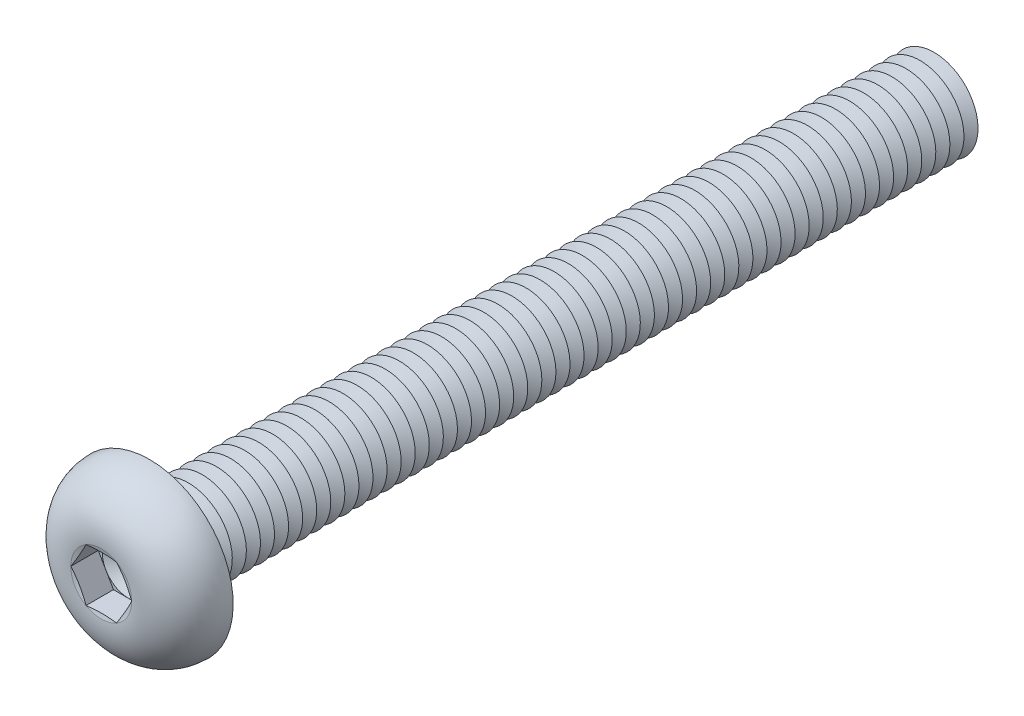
ISO-10303-21;
HEADER;
FILE_DESCRIPTION(('STEP AP214'),'2;1');
FILE_NAME('part.step','',(''),(''),'','','');
FILE_SCHEMA(('AUTOMOTIVE_DESIGN { 1 0 10303 214 1 1 1 1 }'));
ENDSEC;
DATA;
#1=APPLICATION_CONTEXT('core data for automotive mechanical design processes');
#2=APPLICATION_PROTOCOL_DEFINITION('international standard','automotive_design',2000,#1);
#3=PRODUCT_CONTEXT('',#1,'mechanical');
#4=PRODUCT('Part','Part','',(#3));
#5=PRODUCT_RELATED_PRODUCT_CATEGORY('part','',(#4));
#6=PRODUCT_DEFINITION_FORMATION('','',#4);
#7=PRODUCT_DEFINITION_CONTEXT('part definition',#1,'design');
#8=PRODUCT_DEFINITION('design','',#6,#7);
#9=PRODUCT_DEFINITION_SHAPE('','',#8);
#10=(LENGTH_UNIT() NAMED_UNIT(*) SI_UNIT(.MILLI.,.METRE.));
#11=(NAMED_UNIT(*) PLANE_ANGLE_UNIT() SI_UNIT($,.RADIAN.));
#12=(NAMED_UNIT(*) SI_UNIT($,.STERADIAN.) SOLID_ANGLE_UNIT());
#13=UNCERTAINTY_MEASURE_WITH_UNIT(LENGTH_MEASURE(1.E-05),#10,'distance_accuracy_value','');
#14=(GEOMETRIC_REPRESENTATION_CONTEXT(3) GLOBAL_UNCERTAINTY_ASSIGNED_CONTEXT((#13)) GLOBAL_UNIT_ASSIGNED_CONTEXT((#10,
#11,#12)) REPRESENTATION_CONTEXT('',''));
#15=CARTESIAN_POINT('',(0.,0.,0.));
#16=DIRECTION('',(0.,0.,1.));
#17=DIRECTION('',(1.,0.,0.));
#18=AXIS2_PLACEMENT_3D('',#15,#16,#17);
#19=CARTESIAN_POINT('',(0.,0.,1.19));
#20=DIRECTION('',(0.,0.,1.));
#21=DIRECTION('',(1.,0.,0.));
#22=AXIS2_PLACEMENT_3D('',#19,#20,#21);
#23=PLANE('',#22);
#24=CARTESIAN_POINT('',(0.,0.,1.19));
#25=DIRECTION('',(0.,0.,1.));
#26=DIRECTION('',(1.,0.,0.));
#27=AXIS2_PLACEMENT_3D('',#24,#25,#26);
#28=CIRCLE('',#27,1.49999930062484);
#29=CARTESIAN_POINT('',(1.2990375,0.749999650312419,1.19));
#30=VERTEX_POINT('',#29);
#31=CARTESIAN_POINT('',(0.,1.49999930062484,1.19));
#32=VERTEX_POINT('',#31);
#33=EDGE_CURVE('E118',#30,#32,#28,.T.);
#34=ORIENTED_EDGE('',*,*,#33,.F.);
#35=DIRECTION('',(-0.5,0.866025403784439,0.));
#36=VECTOR('',#35,1.);
#37=CARTESIAN_POINT('',(1.73205,0.,1.19));
#38=LINE('',#37,#36);
#39=CARTESIAN_POINT('',(0.866025,1.49999930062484,1.19));
#40=VERTEX_POINT('',#39);
#41=EDGE_CURVE('E125',#30,#40,#38,.T.);
#42=ORIENTED_EDGE('',*,*,#41,.T.);
#43=DIRECTION('',(-1.,0.,0.));
#44=VECTOR('',#43,1.);
#45=CARTESIAN_POINT('',(0.866025,1.49999930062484,1.19));
#46=LINE('',#45,#44);
#47=EDGE_CURVE('E136',#40,#32,#46,.T.);
#48=ORIENTED_EDGE('',*,*,#47,.T.);
#49=EDGE_LOOP('',(#34,#42,#48));
#50=FACE_BOUND('',#49,.T.);
#51=ADVANCED_FACE('F39',(#50),#23,.T.);
#52=CARTESIAN_POINT('',(0.,0.,1.19));
#53=DIRECTION('',(0.,0.,1.));
#54=DIRECTION('',(1.,0.,0.));
#55=AXIS2_PLACEMENT_3D('',#52,#53,#54);
#56=CIRCLE('',#55,1.49999930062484);
#57=CARTESIAN_POINT('',(-1.2990375,0.749999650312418,1.19));
#58=VERTEX_POINT('',#57);
#59=EDGE_CURVE('E11',#32,#58,#56,.T.);
#60=ORIENTED_EDGE('',*,*,#59,.F.);
#61=CARTESIAN_POINT('',(-0.866025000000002,1.49999930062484,1.19));
#62=VERTEX_POINT('',#61);
#63=EDGE_CURVE('E131',#32,#62,#46,.T.);
#64=ORIENTED_EDGE('',*,*,#63,.T.);
#65=DIRECTION('',(-0.5,-0.866025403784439,0.));
#66=VECTOR('',#65,1.);
#67=CARTESIAN_POINT('',(-0.866025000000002,1.49999930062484,1.19));
#68=LINE('',#67,#66);
#69=EDGE_CURVE('E134',#62,#58,#68,.T.);
#70=ORIENTED_EDGE('',*,*,#69,.T.);
#71=EDGE_LOOP('',(#60,#64,#70));
#72=FACE_BOUND('',#71,.T.);
#73=ADVANCED_FACE('F130',(#72),#23,.T.);
#74=CARTESIAN_POINT('',(-1.2990375,-0.749999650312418,1.19));
#75=VERTEX_POINT('',#74);
#76=EDGE_CURVE('E49',#58,#75,#56,.T.);
#77=ORIENTED_EDGE('',*,*,#76,.F.);
#78=CARTESIAN_POINT('',(-1.73205,0.,1.19));
#79=VERTEX_POINT('',#78);
#80=EDGE_CURVE('E143',#58,#79,#68,.T.);
#81=ORIENTED_EDGE('',*,*,#80,.T.);
#82=DIRECTION('',(0.5,-0.866025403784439,0.));
#83=VECTOR('',#82,1.);
#84=CARTESIAN_POINT('',(-1.73205,0.,1.19));
#85=LINE('',#84,#83);
#86=EDGE_CURVE('E152',#79,#75,#85,.T.);
#87=ORIENTED_EDGE('',*,*,#86,.T.);
#88=EDGE_LOOP('',(#77,#81,#87));
#89=FACE_BOUND('',#88,.T.);
#90=ADVANCED_FACE('F721',(#89),#23,.T.);
#91=CARTESIAN_POINT('',(0.,-1.49999930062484,1.19));
#92=VERTEX_POINT('',#91);
#93=EDGE_CURVE('E706',#75,#92,#56,.T.);
#94=ORIENTED_EDGE('',*,*,#93,.F.);
#95=CARTESIAN_POINT('',(-0.866025,-1.49999930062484,1.19));
#96=VERTEX_POINT('',#95);
#97=EDGE_CURVE('E151',#75,#96,#85,.T.);
#98=ORIENTED_EDGE('',*,*,#97,.T.);
#99=DIRECTION('',(1.,0.,0.));
#100=VECTOR('',#99,1.);
#101=CARTESIAN_POINT('',(-0.866025,-1.49999930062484,1.19));
#102=LINE('',#101,#100);
#103=EDGE_CURVE('E157',#96,#92,#102,.T.);
#104=ORIENTED_EDGE('',*,*,#103,.T.);
#105=EDGE_LOOP('',(#94,#98,#104));
#106=FACE_BOUND('',#105,.T.);
#107=ADVANCED_FACE('F714',(#106),#23,.T.);
#108=CARTESIAN_POINT('',(1.2990375,-0.749999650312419,1.19));
#109=VERTEX_POINT('',#108);
#110=EDGE_CURVE('E56',#92,#109,#56,.T.);
#111=ORIENTED_EDGE('',*,*,#110,.F.);
#112=CARTESIAN_POINT('',(0.866025,-1.49999930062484,1.19));
#113=VERTEX_POINT('',#112);
#114=EDGE_CURVE('E156',#92,#113,#102,.T.);
#115=ORIENTED_EDGE('',*,*,#114,.T.);
#116=DIRECTION('',(0.5,0.866025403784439,0.));
#117=VECTOR('',#116,1.);
#118=CARTESIAN_POINT('',(0.866025,-1.49999930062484,1.19));
#119=LINE('',#118,#117);
#120=EDGE_CURVE('E162',#113,#109,#119,.T.);
#121=ORIENTED_EDGE('',*,*,#120,.T.);
#122=EDGE_LOOP('',(#111,#115,#121));
#123=FACE_BOUND('',#122,.T.);
#124=ADVANCED_FACE('F791',(#123),#23,.T.);
#125=CARTESIAN_POINT('',(0.,0.,2.75));
#126=DIRECTION('',(0.,0.,1.));
#127=DIRECTION('',(0.,-1.,0.));
#128=AXIS2_PLACEMENT_3D('',#125,#126,#127);
#129=CONICAL_SURFACE('',#128,1.73205,1.30899693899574);
#130=CARTESIAN_POINT('',(1.73216547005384,-0.000200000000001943,2.75003094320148));
#131=CARTESIAN_POINT('',(1.69619207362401,0.0621077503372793,2.74038633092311));
#132=CARTESIAN_POINT('',(1.66015343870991,0.124528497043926,2.73163050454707));
#133=CARTESIAN_POINT('',(1.58794885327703,0.249590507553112,2.71624720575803));
#134=CARTESIAN_POINT('',(1.5517828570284,0.312231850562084,2.7096205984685));
#135=CARTESIAN_POINT('',(1.47954289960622,0.437355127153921,2.69888271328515));
#136=CARTESIAN_POINT('',(1.4434694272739,0.499836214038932,2.69475862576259));
#137=CARTESIAN_POINT('',(1.37127646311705,0.624878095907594,2.68922863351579));
#138=CARTESIAN_POINT('',(1.33515698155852,0.687438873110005,2.68782220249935));
#139=CARTESIAN_POINT('',(1.26291801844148,0.812560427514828,2.68782220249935));
#140=CARTESIAN_POINT('',(1.22679853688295,0.875121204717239,2.68922863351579));
#141=CARTESIAN_POINT('',(1.1546055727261,1.0001630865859,2.69475862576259));
#142=CARTESIAN_POINT('',(1.11853210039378,1.06264417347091,2.69888271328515));
#143=CARTESIAN_POINT('',(1.0462921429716,1.18776745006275,2.7096205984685));
#144=CARTESIAN_POINT('',(1.01012614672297,1.25040879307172,2.71624720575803));
#145=CARTESIAN_POINT('',(0.937921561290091,1.37547080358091,2.73163050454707));
#146=CARTESIAN_POINT('',(0.901882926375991,1.43789155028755,2.74038633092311));
#147=CARTESIAN_POINT('',(0.865909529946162,1.50019930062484,2.75003094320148));
#148=B_SPLINE_CURVE_WITH_KNOTS('',3,(#130,#131,#132,#133,#134,#135,#136,#137,#138,#139,#140,
#141,#142,#143,#144,#145,#146,#147),.UNSPECIFIED.,.F.,.F.,(4,2,2,2,2,2,2,2,4),(0.,
0.217782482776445,0.435653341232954,0.652399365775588,0.869103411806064,1.08580745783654,
1.30255348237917,1.52042434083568,1.73820682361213),.UNSPECIFIED.);
#149=CARTESIAN_POINT('',(1.73205,0.,2.75));
#150=VERTEX_POINT('',#149);
#151=CARTESIAN_POINT('',(0.866025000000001,1.49999930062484,2.75));
#152=VERTEX_POINT('',#151);
#153=EDGE_CURVE('E222',#150,#152,#148,.T.);
#154=ORIENTED_EDGE('',*,*,#153,.F.);
#155=CARTESIAN_POINT('',(0.,0.,2.75));
#156=DIRECTION('',(0.,0.,-1.));
#157=DIRECTION('',(0.,1.,0.));
#158=AXIS2_PLACEMENT_3D('',#155,#156,#157);
#159=CIRCLE('',#158,1.73205);
#160=EDGE_CURVE('E685',#152,#150,#159,.T.);
#161=ORIENTED_EDGE('',*,*,#160,.F.);
#162=EDGE_LOOP('',(#154,#161));
#163=FACE_BOUND('',#162,.T.);
#164=ADVANCED_FACE('F795',(#163),#129,.F.);
#165=CARTESIAN_POINT('',(0.865909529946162,-1.50019930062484,2.75003094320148));
#166=CARTESIAN_POINT('',(0.901882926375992,-1.43789155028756,2.74038633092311));
#167=CARTESIAN_POINT('',(0.937921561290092,-1.37547080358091,2.73163050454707));
#168=CARTESIAN_POINT('',(1.01012614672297,-1.25040879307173,2.71624720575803));
#169=CARTESIAN_POINT('',(1.0462921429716,-1.18776745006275,2.7096205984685));
#170=CARTESIAN_POINT('',(1.11853210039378,-1.06264417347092,2.69888271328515));
#171=CARTESIAN_POINT('',(1.1546055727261,-1.00016308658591,2.69475862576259));
#172=CARTESIAN_POINT('',(1.22679853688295,-0.875121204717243,2.68922863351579));
#173=CARTESIAN_POINT('',(1.26291801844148,-0.812560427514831,2.68782220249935));
#174=CARTESIAN_POINT('',(1.33515698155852,-0.687438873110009,2.68782220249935));
#175=CARTESIAN_POINT('',(1.37127646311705,-0.624878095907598,2.68922863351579));
#176=CARTESIAN_POINT('',(1.4434694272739,-0.499836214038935,2.69475862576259));
#177=CARTESIAN_POINT('',(1.47954289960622,-0.437355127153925,2.69888271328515));
#178=CARTESIAN_POINT('',(1.5517828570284,-0.312231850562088,2.7096205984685));
#179=CARTESIAN_POINT('',(1.58794885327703,-0.249590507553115,2.71624720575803));
#180=CARTESIAN_POINT('',(1.66015343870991,-0.12452849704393,2.73163050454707));
#181=CARTESIAN_POINT('',(1.69619207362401,-0.0621077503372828,2.74038633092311));
#182=CARTESIAN_POINT('',(1.73216547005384,0.000199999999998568,2.75003094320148));
#183=B_SPLINE_CURVE_WITH_KNOTS('',3,(#165,#166,#167,#168,#169,#170,#171,#172,#173,#174,#175,
#176,#177,#178,#179,#180,#181,#182),.UNSPECIFIED.,.F.,.F.,(4,2,2,2,2,2,2,2,4),(0.,
0.217782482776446,0.435653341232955,0.652399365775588,0.869103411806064,1.08580745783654,
1.30255348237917,1.52042434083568,1.73820682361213),.UNSPECIFIED.);
#184=CARTESIAN_POINT('',(0.866025,-1.49999930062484,2.75));
#185=VERTEX_POINT('',#184);
#186=EDGE_CURVE('E231',#185,#150,#183,.T.);
#187=ORIENTED_EDGE('',*,*,#186,.F.);
#188=EDGE_CURVE('E690',#150,#185,#159,.T.);
#189=ORIENTED_EDGE('',*,*,#188,.F.);
#190=EDGE_LOOP('',(#187,#189));
#191=FACE_BOUND('',#190,.T.);
#192=ADVANCED_FACE('F756',(#191),#129,.F.);
#193=CARTESIAN_POINT('',(-2.61375031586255,-1.49999930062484,3.09338600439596));
#194=CARTESIAN_POINT('',(-2.48719895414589,-1.49999930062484,3.06401688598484));
#195=CARTESIAN_POINT('',(-2.36054180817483,-1.49999930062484,3.03507426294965));
#196=CARTESIAN_POINT('',(-2.10688190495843,-1.49999930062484,2.97862489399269));
#197=CARTESIAN_POINT('',(-1.97987908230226,-1.49999930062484,2.95111844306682));
#198=CARTESIAN_POINT('',(-1.72425281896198,-1.49999930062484,2.89788845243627));
#199=CARTESIAN_POINT('',(-1.59562534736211,-1.49999930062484,2.87218404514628));
#200=CARTESIAN_POINT('',(-1.33776732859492,-1.49999930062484,2.82387586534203));
#201=CARTESIAN_POINT('',(-1.20853672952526,-1.49999930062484,2.80127236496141));
#202=CARTESIAN_POINT('',(-0.952831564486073,-1.49999930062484,2.76126658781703));
#203=CARTESIAN_POINT('',(-0.826376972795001,-1.49999930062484,2.74374018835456));
#204=CARTESIAN_POINT('',(-0.572755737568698,-1.49999930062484,2.71502809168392));
#205=CARTESIAN_POINT('',(-0.44558933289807,-1.49999930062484,2.70384038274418));
#206=CARTESIAN_POINT('',(-0.191333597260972,-1.49999930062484,2.68972083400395));
#207=CARTESIAN_POINT('',(-0.0642464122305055,-1.49999930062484,2.68675270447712));
#208=CARTESIAN_POINT('',(0.189835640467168,-1.49999930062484,2.68959577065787));
#209=CARTESIAN_POINT('',(0.316830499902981,-1.49999930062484,2.69540767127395));
#210=CARTESIAN_POINT('',(0.534182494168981,-1.49999930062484,2.71190493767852));
#211=CARTESIAN_POINT('',(0.624691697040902,-1.49999930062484,2.72073513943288));
#212=CARTESIAN_POINT('',(0.805336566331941,-1.49999930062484,2.74156379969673));
#213=CARTESIAN_POINT('',(0.895472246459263,-1.49999930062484,2.75356214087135));
#214=CARTESIAN_POINT('',(1.0756572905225,-1.49999930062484,2.78006977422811));
#215=CARTESIAN_POINT('',(1.16570548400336,-1.49999930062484,2.7945868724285));
#216=CARTESIAN_POINT('',(1.3454787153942,-1.49999930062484,2.82550612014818));
#217=CARTESIAN_POINT('',(1.43520373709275,-1.49999930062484,2.8419083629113));
#218=CARTESIAN_POINT('',(1.61622412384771,-1.49999930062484,2.87648604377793));
#219=CARTESIAN_POINT('',(1.70751379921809,-1.49999930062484,2.89469103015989));
#220=CARTESIAN_POINT('',(1.88986344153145,-1.49999930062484,2.93221618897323));
#221=CARTESIAN_POINT('',(1.98092340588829,-1.49999930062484,2.95153637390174));
#222=CARTESIAN_POINT('',(2.16236354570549,-1.49999930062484,2.99091506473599));
#223=CARTESIAN_POINT('',(2.25274472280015,-1.49999930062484,3.01096897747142));
#224=CARTESIAN_POINT('',(2.43335289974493,-1.49999930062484,3.05173139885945));
#225=CARTESIAN_POINT('',(2.52357990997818,-1.49999930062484,3.07243986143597));
#226=CARTESIAN_POINT('',(2.61375031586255,-1.49999930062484,3.09338600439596));
#227=B_SPLINE_CURVE_WITH_KNOTS('',3,(#193,#194,#195,#196,#197,#198,#199,#200,#201,#202,#203,
#204,#205,#206,#207,#208,#209,#210,#211,#212,#213,#214,#215,#216,#217,#218,#219,#220,#221,#222,
#223,#224,#225,#226),.UNSPECIFIED.,.F.,.F.,(4,2,2,2,2,2,2,2,2,2,2,2,2,2,2,2,4),(0.,
0.389753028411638,0.779585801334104,1.17307326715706,1.5665952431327,1.94947555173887,
2.33223427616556,2.71330039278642,3.09439710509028,3.36715350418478,3.63989980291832,
3.91350699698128,4.18712773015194,4.4663802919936,4.74563598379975,5.02337106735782,
5.3010866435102),.UNSPECIFIED.);
#228=CARTESIAN_POINT('',(-0.866025,-1.49999930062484,2.75));
#229=VERTEX_POINT('',#228);
#230=EDGE_CURVE('E735',#229,#185,#227,.T.);
#231=ORIENTED_EDGE('',*,*,#230,.F.);
#232=EDGE_CURVE('E748',#185,#229,#159,.T.);
#233=ORIENTED_EDGE('',*,*,#232,.F.);
#234=EDGE_LOOP('',(#231,#233));
#235=FACE_BOUND('',#234,.T.);
#236=ADVANCED_FACE('F762',(#235),#129,.F.);
#237=CARTESIAN_POINT('',(-1.73216547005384,0.000199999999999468,2.75003094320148));
#238=CARTESIAN_POINT('',(-1.69619207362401,-0.062107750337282,2.74038633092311));
#239=CARTESIAN_POINT('',(-1.66015343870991,-0.124528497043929,2.73163050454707));
#240=CARTESIAN_POINT('',(-1.58794885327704,-0.249590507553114,2.71624720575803));
#241=CARTESIAN_POINT('',(-1.55178285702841,-0.312231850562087,2.7096205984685));
#242=CARTESIAN_POINT('',(-1.47954289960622,-0.437355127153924,2.69888271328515));
#243=CARTESIAN_POINT('',(-1.4434694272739,-0.499836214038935,2.69475862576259));
#244=CARTESIAN_POINT('',(-1.37127646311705,-0.624878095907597,2.68922863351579));
#245=CARTESIAN_POINT('',(-1.33515698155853,-0.687438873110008,2.68782220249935));
#246=CARTESIAN_POINT('',(-1.26291801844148,-0.812560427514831,2.68782220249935));
#247=CARTESIAN_POINT('',(-1.22679853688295,-0.875121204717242,2.68922863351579));
#248=CARTESIAN_POINT('',(-1.1546055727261,-1.0001630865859,2.69475862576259));
#249=CARTESIAN_POINT('',(-1.11853210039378,-1.06264417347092,2.69888271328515));
#250=CARTESIAN_POINT('',(-1.0462921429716,-1.18776745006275,2.7096205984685));
#251=CARTESIAN_POINT('',(-1.01012614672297,-1.25040879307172,2.71624720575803));
#252=CARTESIAN_POINT('',(-0.937921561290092,-1.37547080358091,2.73163050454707));
#253=CARTESIAN_POINT('',(-0.901882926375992,-1.43789155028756,2.74038633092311));
#254=CARTESIAN_POINT('',(-0.865909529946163,-1.50019930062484,2.75003094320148));
#255=B_SPLINE_CURVE_WITH_KNOTS('',3,(#237,#238,#239,#240,#241,#242,#243,#244,#245,#246,#247,
#248,#249,#250,#251,#252,#253,#254),.UNSPECIFIED.,.F.,.F.,(4,2,2,2,2,2,2,2,4),(0.,
0.217782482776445,0.435653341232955,0.652399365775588,0.869103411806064,1.08580745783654,
1.30255348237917,1.52042434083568,1.73820682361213),.UNSPECIFIED.);
#256=CARTESIAN_POINT('',(-1.73205,0.,2.75));
#257=VERTEX_POINT('',#256);
#258=EDGE_CURVE('E726',#257,#229,#255,.T.);
#259=ORIENTED_EDGE('',*,*,#258,.F.);
#260=EDGE_CURVE('E732',#229,#257,#159,.T.);
#261=ORIENTED_EDGE('',*,*,#260,.F.);
#262=EDGE_LOOP('',(#259,#261));
#263=FACE_BOUND('',#262,.T.);
#264=ADVANCED_FACE('F730',(#263),#129,.F.);
#265=CARTESIAN_POINT('',(-0.865909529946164,1.50019930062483,2.75003094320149));
#266=CARTESIAN_POINT('',(-0.901882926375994,1.43789155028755,2.74038633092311));
#267=CARTESIAN_POINT('',(-0.937921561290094,1.37547080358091,2.73163050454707));
#268=CARTESIAN_POINT('',(-1.01012614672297,1.25040879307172,2.71624720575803));
#269=CARTESIAN_POINT('',(-1.0462921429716,1.18776745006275,2.7096205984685));
#270=CARTESIAN_POINT('',(-1.11853210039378,1.06264417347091,2.69888271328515));
#271=CARTESIAN_POINT('',(-1.1546055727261,1.0001630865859,2.69475862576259));
#272=CARTESIAN_POINT('',(-1.22679853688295,0.87512120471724,2.68922863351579));
#273=CARTESIAN_POINT('',(-1.26291801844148,0.812560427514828,2.68782220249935));
#274=CARTESIAN_POINT('',(-1.33515698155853,0.687438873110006,2.68782220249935));
#275=CARTESIAN_POINT('',(-1.37127646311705,0.624878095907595,2.68922863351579));
#276=CARTESIAN_POINT('',(-1.4434694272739,0.499836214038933,2.69475862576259));
#277=CARTESIAN_POINT('',(-1.47954289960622,0.437355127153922,2.69888271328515));
#278=CARTESIAN_POINT('',(-1.55178285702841,0.312231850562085,2.7096205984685));
#279=CARTESIAN_POINT('',(-1.58794885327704,0.249590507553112,2.71624720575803));
#280=CARTESIAN_POINT('',(-1.66015343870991,0.124528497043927,2.73163050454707));
#281=CARTESIAN_POINT('',(-1.69619207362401,0.0621077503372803,2.74038633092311));
#282=CARTESIAN_POINT('',(-1.73216547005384,-0.000200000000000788,2.75003094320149));
#283=B_SPLINE_CURVE_WITH_KNOTS('',3,(#265,#266,#267,#268,#269,#270,#271,#272,#273,#274,#275,
#276,#277,#278,#279,#280,#281,#282),.UNSPECIFIED.,.F.,.F.,(4,2,2,2,2,2,2,2,4),(0.,
0.217782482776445,0.435653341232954,0.652399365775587,0.869103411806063,1.08580745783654,
1.30255348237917,1.52042434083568,1.73820682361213),.UNSPECIFIED.);
#284=CARTESIAN_POINT('',(-0.866025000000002,1.49999930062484,2.75));
#285=VERTEX_POINT('',#284);
#286=EDGE_CURVE('E195',#285,#257,#283,.T.);
#287=ORIENTED_EDGE('',*,*,#286,.F.);
#288=EDGE_CURVE('E738',#257,#285,#159,.T.);
#289=ORIENTED_EDGE('',*,*,#288,.F.);
#290=EDGE_LOOP('',(#287,#289));
#291=FACE_BOUND('',#290,.T.);
#292=ADVANCED_FACE('F739',(#291),#129,.F.);
#293=CARTESIAN_POINT('',(0.,0.,-42.2));
#294=DIRECTION('',(0.,0.,1.));
#295=DIRECTION('',(0.,-1.,0.));
#296=AXIS2_PLACEMENT_3D('',#293,#294,#295);
#297=CONICAL_SURFACE('',#296,2.49999999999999,1.04719755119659);
#298=CARTESIAN_POINT('',(0.,0.,-42.6));
#299=DIRECTION('',(0.,0.,1.));
#300=DIRECTION('',(0.,-1.,0.));
#301=AXIS2_PLACEMENT_3D('',#298,#299,#300);
#302=CIRCLE('',#301,1.80717967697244);
#303=CARTESIAN_POINT('',(0.,-1.80717967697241,-42.6));
#304=VERTEX_POINT('',#303);
#305=EDGE_CURVE('E656',#304,#304,#302,.T.);
#306=ORIENTED_EDGE('',*,*,#305,.T.);
#307=EDGE_LOOP('',(#306));
#308=FACE_BOUND('',#307,.T.);
#309=CARTESIAN_POINT('',(0.,0.,-42.2));
#310=DIRECTION('',(0.,0.,1.));
#311=DIRECTION('',(0.,-1.,0.));
#312=AXIS2_PLACEMENT_3D('',#309,#310,#311);
#313=CIRCLE('',#312,2.49999999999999);
#314=CARTESIAN_POINT('',(0.,-2.49999999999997,-42.2));
#315=VERTEX_POINT('',#314);
#316=EDGE_CURVE('E652',#315,#315,#313,.T.);
#317=ORIENTED_EDGE('',*,*,#316,.F.);
#318=EDGE_LOOP('',(#317));
#319=FACE_BOUND('',#318,.T.);
#320=ADVANCED_FACE('F821',(#308,#319),#297,.T.);
#321=CARTESIAN_POINT('',(0.,0.,-42.6));
#322=DIRECTION('',(0.,0.,-1.));
#323=DIRECTION('',(0.,1.,0.));
#324=AXIS2_PLACEMENT_3D('',#321,#322,#323);
#325=CONICAL_SURFACE('',#324,1.80717967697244,1.0471975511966);
#326=CARTESIAN_POINT('',(0.,0.,-43.));
#327=DIRECTION('',(0.,0.,1.));
#328=DIRECTION('',(0.,-1.,0.));
#329=AXIS2_PLACEMENT_3D('',#326,#327,#328);
#330=CIRCLE('',#329,2.49999999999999);
#331=CARTESIAN_POINT('',(0.,-2.49999999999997,-43.));
#332=VERTEX_POINT('',#331);
#333=EDGE_CURVE('E660',#332,#332,#330,.T.);
#334=ORIENTED_EDGE('',*,*,#333,.T.);
#335=EDGE_LOOP('',(#334));
#336=FACE_BOUND('',#335,.T.);
#337=ORIENTED_EDGE('',*,*,#305,.F.);
#338=EDGE_LOOP('',(#337));
#339=FACE_BOUND('',#338,.T.);
#340=ADVANCED_FACE('F826',(#336,#339),#325,.T.);
#341=CARTESIAN_POINT('',(0.,2.5,-45.));
#342=DIRECTION('',(0.,0.,-1.));
#343=DIRECTION('',(0.,1.,0.));
#344=AXIS2_PLACEMENT_3D('',#341,#342,#343);
#345=PLANE('',#344);
#346=CARTESIAN_POINT('',(0.,0.,-45.));
#347=DIRECTION('',(0.,0.,1.));
#348=DIRECTION('',(0.,-1.,0.));
#349=AXIS2_PLACEMENT_3D('',#346,#347,#348);
#350=CIRCLE('',#349,1.80717967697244);
#351=CARTESIAN_POINT('',(0.,-1.80717967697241,-45.));
#352=VERTEX_POINT('',#351);
#353=EDGE_CURVE('E680',#352,#352,#350,.T.);
#354=ORIENTED_EDGE('',*,*,#353,.F.);
#355=EDGE_LOOP('',(#354));
#356=FACE_BOUND('',#355,.T.);
#357=ADVANCED_FACE('F1001',(#356),#345,.T.);
#358=CARTESIAN_POINT('',(0.,0.,-44.6));
#359=DIRECTION('',(0.,0.,1.));
#360=DIRECTION('',(0.,-1.,0.));
#361=AXIS2_PLACEMENT_3D('',#358,#359,#360);
#362=CONICAL_SURFACE('',#361,2.49999999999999,1.04719755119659);
#363=ORIENTED_EDGE('',*,*,#353,.T.);
#364=EDGE_LOOP('',(#363));
#365=FACE_BOUND('',#364,.T.);
#366=CARTESIAN_POINT('',(0.,0.,-44.6));
#367=DIRECTION('',(0.,0.,1.));
#368=DIRECTION('',(0.,-1.,0.));
#369=AXIS2_PLACEMENT_3D('',#366,#367,#368);
#370=CIRCLE('',#369,2.49999999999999);
#371=CARTESIAN_POINT('',(0.,-2.49999999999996,-44.6));
#372=VERTEX_POINT('',#371);
#373=EDGE_CURVE('E676',#372,#372,#370,.T.);
#374=ORIENTED_EDGE('',*,*,#373,.F.);
#375=EDGE_LOOP('',(#374));
#376=FACE_BOUND('',#375,.T.);
#377=ADVANCED_FACE('F994',(#365,#376),#362,.T.);
#378=CARTESIAN_POINT('',(0.,0.,-44.2));
#379=DIRECTION('',(0.,0.,-1.));
#380=DIRECTION('',(0.,1.,0.));
#381=AXIS2_PLACEMENT_3D('',#378,#379,#380);
#382=CONICAL_SURFACE('',#381,1.80717967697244,1.0471975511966);
#383=ORIENTED_EDGE('',*,*,#373,.T.);
#384=EDGE_LOOP('',(#383));
#385=FACE_BOUND('',#384,.T.);
#386=CARTESIAN_POINT('',(0.,0.,-44.2));
#387=DIRECTION('',(0.,0.,1.));
#388=DIRECTION('',(0.,-1.,0.));
#389=AXIS2_PLACEMENT_3D('',#386,#387,#388);
#390=CIRCLE('',#389,1.80717967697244);
#391=CARTESIAN_POINT('',(0.,-1.80717967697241,-44.2));
#392=VERTEX_POINT('',#391);
#393=EDGE_CURVE('E672',#392,#392,#390,.T.);
#394=ORIENTED_EDGE('',*,*,#393,.F.);
#395=EDGE_LOOP('',(#394));
#396=FACE_BOUND('',#395,.T.);
#397=ADVANCED_FACE('F1000',(#385,#396),#382,.T.);
#398=CARTESIAN_POINT('',(0.,0.,-43.8));
#399=DIRECTION('',(0.,0.,1.));
#400=DIRECTION('',(0.,-1.,0.));
#401=AXIS2_PLACEMENT_3D('',#398,#399,#400);
#402=CONICAL_SURFACE('',#401,2.49999999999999,1.04719755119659);
#403=ORIENTED_EDGE('',*,*,#393,.T.);
#404=EDGE_LOOP('',(#403));
#405=FACE_BOUND('',#404,.T.);
#406=CARTESIAN_POINT('',(0.,0.,-43.8));
#407=DIRECTION('',(0.,0.,1.));
#408=DIRECTION('',(0.,-1.,0.));
#409=AXIS2_PLACEMENT_3D('',#406,#407,#408);
#410=CIRCLE('',#409,2.49999999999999);
#411=CARTESIAN_POINT('',(0.,-2.49999999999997,-43.8));
#412=VERTEX_POINT('',#411);
#413=EDGE_CURVE('E668',#412,#412,#410,.T.);
#414=ORIENTED_EDGE('',*,*,#413,.F.);
#415=EDGE_LOOP('',(#414));
#416=FACE_BOUND('',#415,.T.);
#417=ADVANCED_FACE('F1032',(#405,#416),#402,.T.);
#418=CARTESIAN_POINT('',(0.,0.,-43.4));
#419=DIRECTION('',(0.,0.,-1.));
#420=DIRECTION('',(0.,1.,0.));
#421=AXIS2_PLACEMENT_3D('',#418,#419,#420);
#422=CONICAL_SURFACE('',#421,1.80717967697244,1.0471975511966);
#423=ORIENTED_EDGE('',*,*,#413,.T.);
#424=EDGE_LOOP('',(#423));
#425=FACE_BOUND('',#424,.T.);
#426=CARTESIAN_POINT('',(0.,0.,-43.4));
#427=DIRECTION('',(0.,0.,1.));
#428=DIRECTION('',(0.,-1.,0.));
#429=AXIS2_PLACEMENT_3D('',#426,#427,#428);
#430=CIRCLE('',#429,1.80717967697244);
#431=CARTESIAN_POINT('',(0.,-1.80717967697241,-43.4));
#432=VERTEX_POINT('',#431);
#433=EDGE_CURVE('E664',#432,#432,#430,.T.);
#434=ORIENTED_EDGE('',*,*,#433,.F.);
#435=EDGE_LOOP('',(#434));
#436=FACE_BOUND('',#435,.T.);
#437=ADVANCED_FACE('F1042',(#425,#436),#422,.T.);
#438=CARTESIAN_POINT('',(0.,0.,-43.));
#439=DIRECTION('',(0.,0.,1.));
#440=DIRECTION('',(0.,-1.,0.));
#441=AXIS2_PLACEMENT_3D('',#438,#439,#440);
#442=CONICAL_SURFACE('',#441,2.49999999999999,1.04719755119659);
#443=ORIENTED_EDGE('',*,*,#433,.T.);
#444=EDGE_LOOP('',(#443));
#445=FACE_BOUND('',#444,.T.);
#446=ORIENTED_EDGE('',*,*,#333,.F.);
#447=EDGE_LOOP('',(#446));
#448=FACE_BOUND('',#447,.T.);
#449=ADVANCED_FACE('F1052',(#445,#448),#442,.T.);
#450=CARTESIAN_POINT('',(0.,0.,-41.4));
#451=DIRECTION('',(0.,0.,1.));
#452=DIRECTION('',(0.,-1.,0.));
#453=AXIS2_PLACEMENT_3D('',#450,#451,#452);
#454=CONICAL_SURFACE('',#453,2.49999999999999,1.04719755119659);
#455=CARTESIAN_POINT('',(0.,0.,-41.8));
#456=DIRECTION('',(0.,0.,1.));
#457=DIRECTION('',(0.,-1.,0.));
#458=AXIS2_PLACEMENT_3D('',#455,#456,#457);
#459=CIRCLE('',#458,1.80717967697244);
#460=CARTESIAN_POINT('',(0.,-1.80717967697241,-41.8));
#461=VERTEX_POINT('',#460);
#462=EDGE_CURVE('E648',#461,#461,#459,.T.);
#463=ORIENTED_EDGE('',*,*,#462,.T.);
#464=EDGE_LOOP('',(#463));
#465=FACE_BOUND('',#464,.T.);
#466=CARTESIAN_POINT('',(0.,0.,-41.4));
#467=DIRECTION('',(0.,0.,1.));
#468=DIRECTION('',(0.,-1.,0.));
#469=AXIS2_PLACEMENT_3D('',#466,#467,#468);
#470=CIRCLE('',#469,2.49999999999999);
#471=CARTESIAN_POINT('',(0.,-2.49999999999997,-41.4));
#472=VERTEX_POINT('',#471);
#473=EDGE_CURVE('E644',#472,#472,#470,.T.);
#474=ORIENTED_EDGE('',*,*,#473,.F.);
#475=EDGE_LOOP('',(#474));
#476=FACE_BOUND('',#475,.T.);
#477=ADVANCED_FACE('F1062',(#465,#476),#454,.T.);
#478=CARTESIAN_POINT('',(0.,0.,-41.8));
#479=DIRECTION('',(0.,0.,-1.));
#480=DIRECTION('',(0.,1.,0.));
#481=AXIS2_PLACEMENT_3D('',#478,#479,#480);
#482=CONICAL_SURFACE('',#481,1.80717967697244,1.0471975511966);
#483=ORIENTED_EDGE('',*,*,#316,.T.);
#484=EDGE_LOOP('',(#483));
#485=FACE_BOUND('',#484,.T.);
#486=ORIENTED_EDGE('',*,*,#462,.F.);
#487=EDGE_LOOP('',(#486));
#488=FACE_BOUND('',#487,.T.);
#489=ADVANCED_FACE('F1072',(#485,#488),#482,.T.);
#490=CARTESIAN_POINT('',(0.,0.,-40.6));
#491=DIRECTION('',(0.,0.,1.));
#492=DIRECTION('',(0.,-1.,0.));
#493=AXIS2_PLACEMENT_3D('',#490,#491,#492);
#494=CONICAL_SURFACE('',#493,2.49999999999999,1.04719755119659);
#495=CARTESIAN_POINT('',(0.,0.,-41.));
#496=DIRECTION('',(0.,0.,1.));
#497=DIRECTION('',(0.,-1.,0.));
#498=AXIS2_PLACEMENT_3D('',#495,#496,#497);
#499=CIRCLE('',#498,1.80717967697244);
#500=CARTESIAN_POINT('',(0.,-1.80717967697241,-41.));
#501=VERTEX_POINT('',#500);
#502=EDGE_CURVE('E640',#501,#501,#499,.T.);
#503=ORIENTED_EDGE('',*,*,#502,.T.);
#504=EDGE_LOOP('',(#503));
#505=FACE_BOUND('',#504,.T.);
#506=CARTESIAN_POINT('',(0.,0.,-40.6));
#507=DIRECTION('',(0.,0.,1.));
#508=DIRECTION('',(0.,-1.,0.));
#509=AXIS2_PLACEMENT_3D('',#506,#507,#508);
#510=CIRCLE('',#509,2.49999999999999);
#511=CARTESIAN_POINT('',(0.,-2.49999999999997,-40.6));
#512=VERTEX_POINT('',#511);
#513=EDGE_CURVE('E636',#512,#512,#510,.T.);
#514=ORIENTED_EDGE('',*,*,#513,.F.);
#515=EDGE_LOOP('',(#514));
#516=FACE_BOUND('',#515,.T.);
#517=ADVANCED_FACE('F1082',(#505,#516),#494,.T.);
#518=CARTESIAN_POINT('',(0.,0.,-41.));
#519=DIRECTION('',(0.,0.,-1.));
#520=DIRECTION('',(0.,1.,0.));
#521=AXIS2_PLACEMENT_3D('',#518,#519,#520);
#522=CONICAL_SURFACE('',#521,1.80717967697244,1.0471975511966);
#523=ORIENTED_EDGE('',*,*,#473,.T.);
#524=EDGE_LOOP('',(#523));
#525=FACE_BOUND('',#524,.T.);
#526=ORIENTED_EDGE('',*,*,#502,.F.);
#527=EDGE_LOOP('',(#526));
#528=FACE_BOUND('',#527,.T.);
#529=ADVANCED_FACE('F1092',(#525,#528),#522,.T.);
#530=CARTESIAN_POINT('',(0.,0.,-39.8));
#531=DIRECTION('',(0.,0.,1.));
#532=DIRECTION('',(0.,-1.,0.));
#533=AXIS2_PLACEMENT_3D('',#530,#531,#532);
#534=CONICAL_SURFACE('',#533,2.49999999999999,1.04719755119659);
#535=CARTESIAN_POINT('',(0.,0.,-40.2));
#536=DIRECTION('',(0.,0.,1.));
#537=DIRECTION('',(0.,-1.,0.));
#538=AXIS2_PLACEMENT_3D('',#535,#536,#537);
#539=CIRCLE('',#538,1.80717967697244);
#540=CARTESIAN_POINT('',(0.,-1.80717967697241,-40.2));
#541=VERTEX_POINT('',#540);
#542=EDGE_CURVE('E632',#541,#541,#539,.T.);
#543=ORIENTED_EDGE('',*,*,#542,.T.);
#544=EDGE_LOOP('',(#543));
#545=FACE_BOUND('',#544,.T.);
#546=CARTESIAN_POINT('',(0.,0.,-39.8));
#547=DIRECTION('',(0.,0.,1.));
#548=DIRECTION('',(0.,-1.,0.));
#549=AXIS2_PLACEMENT_3D('',#546,#547,#548);
#550=CIRCLE('',#549,2.49999999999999);
#551=CARTESIAN_POINT('',(0.,-2.49999999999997,-39.8));
#552=VERTEX_POINT('',#551);
#553=EDGE_CURVE('E628',#552,#552,#550,.T.);
#554=ORIENTED_EDGE('',*,*,#553,.F.);
#555=EDGE_LOOP('',(#554));
#556=FACE_BOUND('',#555,.T.);
#557=ADVANCED_FACE('F1102',(#545,#556),#534,.T.);
#558=CARTESIAN_POINT('',(0.,0.,-40.2));
#559=DIRECTION('',(0.,0.,-1.));
#560=DIRECTION('',(0.,1.,0.));
#561=AXIS2_PLACEMENT_3D('',#558,#559,#560);
#562=CONICAL_SURFACE('',#561,1.80717967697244,1.0471975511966);
#563=ORIENTED_EDGE('',*,*,#513,.T.);
#564=EDGE_LOOP('',(#563));
#565=FACE_BOUND('',#564,.T.);
#566=ORIENTED_EDGE('',*,*,#542,.F.);
#567=EDGE_LOOP('',(#566));
#568=FACE_BOUND('',#567,.T.);
#569=ADVANCED_FACE('F1112',(#565,#568),#562,.T.);
#570=CARTESIAN_POINT('',(0.,0.,-39.));
#571=DIRECTION('',(0.,0.,1.));
#572=DIRECTION('',(0.,-1.,0.));
#573=AXIS2_PLACEMENT_3D('',#570,#571,#572);
#574=CONICAL_SURFACE('',#573,2.49999999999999,1.04719755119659);
#575=CARTESIAN_POINT('',(0.,0.,-39.4));
#576=DIRECTION('',(0.,0.,1.));
#577=DIRECTION('',(0.,-1.,0.));
#578=AXIS2_PLACEMENT_3D('',#575,#576,#577);
#579=CIRCLE('',#578,1.80717967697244);
#580=CARTESIAN_POINT('',(0.,-1.80717967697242,-39.4));
#581=VERTEX_POINT('',#580);
#582=EDGE_CURVE('E624',#581,#581,#579,.T.);
#583=ORIENTED_EDGE('',*,*,#582,.T.);
#584=EDGE_LOOP('',(#583));
#585=FACE_BOUND('',#584,.T.);
#586=CARTESIAN_POINT('',(0.,0.,-39.));
#587=DIRECTION('',(0.,0.,1.));
#588=DIRECTION('',(0.,-1.,0.));
#589=AXIS2_PLACEMENT_3D('',#586,#587,#588);
#590=CIRCLE('',#589,2.49999999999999);
#591=CARTESIAN_POINT('',(0.,-2.49999999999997,-39.));
#592=VERTEX_POINT('',#591);
#593=EDGE_CURVE('E620',#592,#592,#590,.T.);
#594=ORIENTED_EDGE('',*,*,#593,.F.);
#595=EDGE_LOOP('',(#594));
#596=FACE_BOUND('',#595,.T.);
#597=ADVANCED_FACE('F1122',(#585,#596),#574,.T.);
#598=CARTESIAN_POINT('',(0.,0.,-39.4));
#599=DIRECTION('',(0.,0.,-1.));
#600=DIRECTION('',(0.,1.,0.));
#601=AXIS2_PLACEMENT_3D('',#598,#599,#600);
#602=CONICAL_SURFACE('',#601,1.80717967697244,1.0471975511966);
#603=ORIENTED_EDGE('',*,*,#553,.T.);
#604=EDGE_LOOP('',(#603));
#605=FACE_BOUND('',#604,.T.);
#606=ORIENTED_EDGE('',*,*,#582,.F.);
#607=EDGE_LOOP('',(#606));
#608=FACE_BOUND('',#607,.T.);
#609=ADVANCED_FACE('F1132',(#605,#608),#602,.T.);
#610=CARTESIAN_POINT('',(0.,0.,-38.2));
#611=DIRECTION('',(0.,0.,1.));
#612=DIRECTION('',(0.,-1.,0.));
#613=AXIS2_PLACEMENT_3D('',#610,#611,#612);
#614=CONICAL_SURFACE('',#613,2.49999999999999,1.04719755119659);
#615=CARTESIAN_POINT('',(0.,0.,-38.6));
#616=DIRECTION('',(0.,0.,1.));
#617=DIRECTION('',(0.,-1.,0.));
#618=AXIS2_PLACEMENT_3D('',#615,#616,#617);
#619=CIRCLE('',#618,1.80717967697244);
#620=CARTESIAN_POINT('',(0.,-1.80717967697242,-38.6));
#621=VERTEX_POINT('',#620);
#622=EDGE_CURVE('E616',#621,#621,#619,.T.);
#623=ORIENTED_EDGE('',*,*,#622,.T.);
#624=EDGE_LOOP('',(#623));
#625=FACE_BOUND('',#624,.T.);
#626=CARTESIAN_POINT('',(0.,0.,-38.2));
#627=DIRECTION('',(0.,0.,1.));
#628=DIRECTION('',(0.,-1.,0.));
#629=AXIS2_PLACEMENT_3D('',#626,#627,#628);
#630=CIRCLE('',#629,2.49999999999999);
#631=CARTESIAN_POINT('',(0.,-2.49999999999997,-38.2));
#632=VERTEX_POINT('',#631);
#633=EDGE_CURVE('E612',#632,#632,#630,.T.);
#634=ORIENTED_EDGE('',*,*,#633,.F.);
#635=EDGE_LOOP('',(#634));
#636=FACE_BOUND('',#635,.T.);
#637=ADVANCED_FACE('F1142',(#625,#636),#614,.T.);
#638=CARTESIAN_POINT('',(0.,0.,-38.6));
#639=DIRECTION('',(0.,0.,-1.));
#640=DIRECTION('',(0.,1.,0.));
#641=AXIS2_PLACEMENT_3D('',#638,#639,#640);
#642=CONICAL_SURFACE('',#641,1.80717967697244,1.0471975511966);
#643=ORIENTED_EDGE('',*,*,#593,.T.);
#644=EDGE_LOOP('',(#643));
#645=FACE_BOUND('',#644,.T.);
#646=ORIENTED_EDGE('',*,*,#622,.F.);
#647=EDGE_LOOP('',(#646));
#648=FACE_BOUND('',#647,.T.);
#649=ADVANCED_FACE('F1152',(#645,#648),#642,.T.);
#650=CARTESIAN_POINT('',(0.,0.,-37.4));
#651=DIRECTION('',(0.,0.,1.));
#652=DIRECTION('',(0.,-1.,0.));
#653=AXIS2_PLACEMENT_3D('',#650,#651,#652);
#654=CONICAL_SURFACE('',#653,2.49999999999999,1.04719755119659);
#655=CARTESIAN_POINT('',(0.,0.,-37.8));
#656=DIRECTION('',(0.,0.,1.));
#657=DIRECTION('',(0.,-1.,0.));
#658=AXIS2_PLACEMENT_3D('',#655,#656,#657);
#659=CIRCLE('',#658,1.80717967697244);
#660=CARTESIAN_POINT('',(0.,-1.80717967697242,-37.8));
#661=VERTEX_POINT('',#660);
#662=EDGE_CURVE('E608',#661,#661,#659,.T.);
#663=ORIENTED_EDGE('',*,*,#662,.T.);
#664=EDGE_LOOP('',(#663));
#665=FACE_BOUND('',#664,.T.);
#666=CARTESIAN_POINT('',(0.,0.,-37.4));
#667=DIRECTION('',(0.,0.,1.));
#668=DIRECTION('',(0.,-1.,0.));
#669=AXIS2_PLACEMENT_3D('',#666,#667,#668);
#670=CIRCLE('',#669,2.49999999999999);
#671=CARTESIAN_POINT('',(0.,-2.49999999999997,-37.4));
#672=VERTEX_POINT('',#671);
#673=EDGE_CURVE('E604',#672,#672,#670,.T.);
#674=ORIENTED_EDGE('',*,*,#673,.F.);
#675=EDGE_LOOP('',(#674));
#676=FACE_BOUND('',#675,.T.);
#677=ADVANCED_FACE('F1162',(#665,#676),#654,.T.);
#678=CARTESIAN_POINT('',(0.,0.,-37.8));
#679=DIRECTION('',(0.,0.,-1.));
#680=DIRECTION('',(0.,1.,0.));
#681=AXIS2_PLACEMENT_3D('',#678,#679,#680);
#682=CONICAL_SURFACE('',#681,1.80717967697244,1.0471975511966);
#683=ORIENTED_EDGE('',*,*,#633,.T.);
#684=EDGE_LOOP('',(#683));
#685=FACE_BOUND('',#684,.T.);
#686=ORIENTED_EDGE('',*,*,#662,.F.);
#687=EDGE_LOOP('',(#686));
#688=FACE_BOUND('',#687,.T.);
#689=ADVANCED_FACE('F1172',(#685,#688),#682,.T.);
#690=CARTESIAN_POINT('',(0.,0.,-36.6));
#691=DIRECTION('',(0.,0.,1.));
#692=DIRECTION('',(0.,-1.,0.));
#693=AXIS2_PLACEMENT_3D('',#690,#691,#692);
#694=CONICAL_SURFACE('',#693,2.49999999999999,1.04719755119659);
#695=CARTESIAN_POINT('',(0.,0.,-37.));
#696=DIRECTION('',(0.,0.,1.));
#697=DIRECTION('',(0.,-1.,0.));
#698=AXIS2_PLACEMENT_3D('',#695,#696,#697);
#699=CIRCLE('',#698,1.80717967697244);
#700=CARTESIAN_POINT('',(0.,-1.80717967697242,-37.));
#701=VERTEX_POINT('',#700);
#702=EDGE_CURVE('E600',#701,#701,#699,.T.);
#703=ORIENTED_EDGE('',*,*,#702,.T.);
#704=EDGE_LOOP('',(#703));
#705=FACE_BOUND('',#704,.T.);
#706=CARTESIAN_POINT('',(0.,0.,-36.6));
#707=DIRECTION('',(0.,0.,1.));
#708=DIRECTION('',(0.,-1.,0.));
#709=AXIS2_PLACEMENT_3D('',#706,#707,#708);
#710=CIRCLE('',#709,2.49999999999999);
#711=CARTESIAN_POINT('',(0.,-2.49999999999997,-36.6));
#712=VERTEX_POINT('',#711);
#713=EDGE_CURVE('E596',#712,#712,#710,.T.);
#714=ORIENTED_EDGE('',*,*,#713,.F.);
#715=EDGE_LOOP('',(#714));
#716=FACE_BOUND('',#715,.T.);
#717=ADVANCED_FACE('F1182',(#705,#716),#694,.T.);
#718=CARTESIAN_POINT('',(0.,0.,-37.));
#719=DIRECTION('',(0.,0.,-1.));
#720=DIRECTION('',(0.,1.,0.));
#721=AXIS2_PLACEMENT_3D('',#718,#719,#720);
#722=CONICAL_SURFACE('',#721,1.80717967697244,1.0471975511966);
#723=ORIENTED_EDGE('',*,*,#673,.T.);
#724=EDGE_LOOP('',(#723));
#725=FACE_BOUND('',#724,.T.);
#726=ORIENTED_EDGE('',*,*,#702,.F.);
#727=EDGE_LOOP('',(#726));
#728=FACE_BOUND('',#727,.T.);
#729=ADVANCED_FACE('F1192',(#725,#728),#722,.T.);
#730=CARTESIAN_POINT('',(0.,0.,-35.8));
#731=DIRECTION('',(0.,0.,1.));
#732=DIRECTION('',(0.,-1.,0.));
#733=AXIS2_PLACEMENT_3D('',#730,#731,#732);
#734=CONICAL_SURFACE('',#733,2.49999999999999,1.04719755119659);
#735=CARTESIAN_POINT('',(0.,0.,-36.2));
#736=DIRECTION('',(0.,0.,1.));
#737=DIRECTION('',(0.,-1.,0.));
#738=AXIS2_PLACEMENT_3D('',#735,#736,#737);
#739=CIRCLE('',#738,1.80717967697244);
#740=CARTESIAN_POINT('',(0.,-1.80717967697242,-36.2));
#741=VERTEX_POINT('',#740);
#742=EDGE_CURVE('E592',#741,#741,#739,.T.);
#743=ORIENTED_EDGE('',*,*,#742,.T.);
#744=EDGE_LOOP('',(#743));
#745=FACE_BOUND('',#744,.T.);
#746=CARTESIAN_POINT('',(0.,0.,-35.8));
#747=DIRECTION('',(0.,0.,1.));
#748=DIRECTION('',(0.,-1.,0.));
#749=AXIS2_PLACEMENT_3D('',#746,#747,#748);
#750=CIRCLE('',#749,2.49999999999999);
#751=CARTESIAN_POINT('',(0.,-2.49999999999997,-35.8));
#752=VERTEX_POINT('',#751);
#753=EDGE_CURVE('E588',#752,#752,#750,.T.);
#754=ORIENTED_EDGE('',*,*,#753,.F.);
#755=EDGE_LOOP('',(#754));
#756=FACE_BOUND('',#755,.T.);
#757=ADVANCED_FACE('F1202',(#745,#756),#734,.T.);
#758=CARTESIAN_POINT('',(0.,0.,-36.2));
#759=DIRECTION('',(0.,0.,-1.));
#760=DIRECTION('',(0.,1.,0.));
#761=AXIS2_PLACEMENT_3D('',#758,#759,#760);
#762=CONICAL_SURFACE('',#761,1.80717967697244,1.0471975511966);
#763=ORIENTED_EDGE('',*,*,#713,.T.);
#764=EDGE_LOOP('',(#763));
#765=FACE_BOUND('',#764,.T.);
#766=ORIENTED_EDGE('',*,*,#742,.F.);
#767=EDGE_LOOP('',(#766));
#768=FACE_BOUND('',#767,.T.);
#769=ADVANCED_FACE('F1212',(#765,#768),#762,.T.);
#770=CARTESIAN_POINT('',(0.,0.,-35.));
#771=DIRECTION('',(0.,0.,1.));
#772=DIRECTION('',(0.,-1.,0.));
#773=AXIS2_PLACEMENT_3D('',#770,#771,#772);
#774=CONICAL_SURFACE('',#773,2.49999999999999,1.04719755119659);
#775=CARTESIAN_POINT('',(0.,0.,-35.4));
#776=DIRECTION('',(0.,0.,1.));
#777=DIRECTION('',(0.,-1.,0.));
#778=AXIS2_PLACEMENT_3D('',#775,#776,#777);
#779=CIRCLE('',#778,1.80717967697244);
#780=CARTESIAN_POINT('',(0.,-1.80717967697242,-35.4));
#781=VERTEX_POINT('',#780);
#782=EDGE_CURVE('E584',#781,#781,#779,.T.);
#783=ORIENTED_EDGE('',*,*,#782,.T.);
#784=EDGE_LOOP('',(#783));
#785=FACE_BOUND('',#784,.T.);
#786=CARTESIAN_POINT('',(0.,0.,-35.));
#787=DIRECTION('',(0.,0.,1.));
#788=DIRECTION('',(0.,-1.,0.));
#789=AXIS2_PLACEMENT_3D('',#786,#787,#788);
#790=CIRCLE('',#789,2.49999999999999);
#791=CARTESIAN_POINT('',(0.,-2.49999999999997,-35.));
#792=VERTEX_POINT('',#791);
#793=EDGE_CURVE('E580',#792,#792,#790,.T.);
#794=ORIENTED_EDGE('',*,*,#793,.F.);
#795=EDGE_LOOP('',(#794));
#796=FACE_BOUND('',#795,.T.);
#797=ADVANCED_FACE('F1222',(#785,#796),#774,.T.);
#798=CARTESIAN_POINT('',(0.,0.,-35.4));
#799=DIRECTION('',(0.,0.,-1.));
#800=DIRECTION('',(0.,1.,0.));
#801=AXIS2_PLACEMENT_3D('',#798,#799,#800);
#802=CONICAL_SURFACE('',#801,1.80717967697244,1.0471975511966);
#803=ORIENTED_EDGE('',*,*,#753,.T.);
#804=EDGE_LOOP('',(#803));
#805=FACE_BOUND('',#804,.T.);
#806=ORIENTED_EDGE('',*,*,#782,.F.);
#807=EDGE_LOOP('',(#806));
#808=FACE_BOUND('',#807,.T.);
#809=ADVANCED_FACE('F1232',(#805,#808),#802,.T.);
#810=CARTESIAN_POINT('',(0.,0.,-34.2));
#811=DIRECTION('',(0.,0.,1.));
#812=DIRECTION('',(0.,-1.,0.));
#813=AXIS2_PLACEMENT_3D('',#810,#811,#812);
#814=CONICAL_SURFACE('',#813,2.49999999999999,1.04719755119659);
#815=CARTESIAN_POINT('',(0.,0.,-34.6));
#816=DIRECTION('',(0.,0.,1.));
#817=DIRECTION('',(0.,-1.,0.));
#818=AXIS2_PLACEMENT_3D('',#815,#816,#817);
#819=CIRCLE('',#818,1.80717967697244);
#820=CARTESIAN_POINT('',(0.,-1.80717967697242,-34.6));
#821=VERTEX_POINT('',#820);
#822=EDGE_CURVE('E576',#821,#821,#819,.T.);
#823=ORIENTED_EDGE('',*,*,#822,.T.);
#824=EDGE_LOOP('',(#823));
#825=FACE_BOUND('',#824,.T.);
#826=CARTESIAN_POINT('',(0.,0.,-34.2));
#827=DIRECTION('',(0.,0.,1.));
#828=DIRECTION('',(0.,-1.,0.));
#829=AXIS2_PLACEMENT_3D('',#826,#827,#828);
#830=CIRCLE('',#829,2.49999999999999);
#831=CARTESIAN_POINT('',(0.,-2.49999999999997,-34.2));
#832=VERTEX_POINT('',#831);
#833=EDGE_CURVE('E572',#832,#832,#830,.T.);
#834=ORIENTED_EDGE('',*,*,#833,.F.);
#835=EDGE_LOOP('',(#834));
#836=FACE_BOUND('',#835,.T.);
#837=ADVANCED_FACE('F1242',(#825,#836),#814,.T.);
#838=CARTESIAN_POINT('',(0.,0.,-34.6));
#839=DIRECTION('',(0.,0.,-1.));
#840=DIRECTION('',(0.,1.,0.));
#841=AXIS2_PLACEMENT_3D('',#838,#839,#840);
#842=CONICAL_SURFACE('',#841,1.80717967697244,1.0471975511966);
#843=ORIENTED_EDGE('',*,*,#793,.T.);
#844=EDGE_LOOP('',(#843));
#845=FACE_BOUND('',#844,.T.);
#846=ORIENTED_EDGE('',*,*,#822,.F.);
#847=EDGE_LOOP('',(#846));
#848=FACE_BOUND('',#847,.T.);
#849=ADVANCED_FACE('F1252',(#845,#848),#842,.T.);
#850=CARTESIAN_POINT('',(0.,0.,-33.4));
#851=DIRECTION('',(0.,0.,1.));
#852=DIRECTION('',(0.,-1.,0.));
#853=AXIS2_PLACEMENT_3D('',#850,#851,#852);
#854=CONICAL_SURFACE('',#853,2.49999999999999,1.04719755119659);
#855=CARTESIAN_POINT('',(0.,0.,-33.8));
#856=DIRECTION('',(0.,0.,1.));
#857=DIRECTION('',(0.,-1.,0.));
#858=AXIS2_PLACEMENT_3D('',#855,#856,#857);
#859=CIRCLE('',#858,1.80717967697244);
#860=CARTESIAN_POINT('',(0.,-1.80717967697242,-33.8));
#861=VERTEX_POINT('',#860);
#862=EDGE_CURVE('E568',#861,#861,#859,.T.);
#863=ORIENTED_EDGE('',*,*,#862,.T.);
#864=EDGE_LOOP('',(#863));
#865=FACE_BOUND('',#864,.T.);
#866=CARTESIAN_POINT('',(0.,0.,-33.4));
#867=DIRECTION('',(0.,0.,1.));
#868=DIRECTION('',(0.,-1.,0.));
#869=AXIS2_PLACEMENT_3D('',#866,#867,#868);
#870=CIRCLE('',#869,2.49999999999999);
#871=CARTESIAN_POINT('',(0.,-2.49999999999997,-33.4));
#872=VERTEX_POINT('',#871);
#873=EDGE_CURVE('E564',#872,#872,#870,.T.);
#874=ORIENTED_EDGE('',*,*,#873,.F.);
#875=EDGE_LOOP('',(#874));
#876=FACE_BOUND('',#875,.T.);
#877=ADVANCED_FACE('F1262',(#865,#876),#854,.T.);
#878=CARTESIAN_POINT('',(0.,0.,-33.8));
#879=DIRECTION('',(0.,0.,-1.));
#880=DIRECTION('',(0.,1.,0.));
#881=AXIS2_PLACEMENT_3D('',#878,#879,#880);
#882=CONICAL_SURFACE('',#881,1.80717967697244,1.0471975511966);
#883=ORIENTED_EDGE('',*,*,#833,.T.);
#884=EDGE_LOOP('',(#883));
#885=FACE_BOUND('',#884,.T.);
#886=ORIENTED_EDGE('',*,*,#862,.F.);
#887=EDGE_LOOP('',(#886));
#888=FACE_BOUND('',#887,.T.);
#889=ADVANCED_FACE('F1272',(#885,#888),#882,.T.);
#890=CARTESIAN_POINT('',(0.,0.,-32.6));
#891=DIRECTION('',(0.,0.,1.));
#892=DIRECTION('',(0.,-1.,0.));
#893=AXIS2_PLACEMENT_3D('',#890,#891,#892);
#894=CONICAL_SURFACE('',#893,2.49999999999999,1.04719755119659);
#895=CARTESIAN_POINT('',(0.,0.,-33.));
#896=DIRECTION('',(0.,0.,1.));
#897=DIRECTION('',(0.,-1.,0.));
#898=AXIS2_PLACEMENT_3D('',#895,#896,#897);
#899=CIRCLE('',#898,1.80717967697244);
#900=CARTESIAN_POINT('',(0.,-1.80717967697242,-33.));
#901=VERTEX_POINT('',#900);
#902=EDGE_CURVE('E560',#901,#901,#899,.T.);
#903=ORIENTED_EDGE('',*,*,#902,.T.);
#904=EDGE_LOOP('',(#903));
#905=FACE_BOUND('',#904,.T.);
#906=CARTESIAN_POINT('',(0.,0.,-32.6));
#907=DIRECTION('',(0.,0.,1.));
#908=DIRECTION('',(0.,-1.,0.));
#909=AXIS2_PLACEMENT_3D('',#906,#907,#908);
#910=CIRCLE('',#909,2.49999999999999);
#911=CARTESIAN_POINT('',(0.,-2.49999999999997,-32.6));
#912=VERTEX_POINT('',#911);
#913=EDGE_CURVE('E556',#912,#912,#910,.T.);
#914=ORIENTED_EDGE('',*,*,#913,.F.);
#915=EDGE_LOOP('',(#914));
#916=FACE_BOUND('',#915,.T.);
#917=ADVANCED_FACE('F1282',(#905,#916),#894,.T.);
#918=CARTESIAN_POINT('',(0.,0.,-33.));
#919=DIRECTION('',(0.,0.,-1.));
#920=DIRECTION('',(0.,1.,0.));
#921=AXIS2_PLACEMENT_3D('',#918,#919,#920);
#922=CONICAL_SURFACE('',#921,1.80717967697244,1.0471975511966);
#923=ORIENTED_EDGE('',*,*,#873,.T.);
#924=EDGE_LOOP('',(#923));
#925=FACE_BOUND('',#924,.T.);
#926=ORIENTED_EDGE('',*,*,#902,.F.);
#927=EDGE_LOOP('',(#926));
#928=FACE_BOUND('',#927,.T.);
#929=ADVANCED_FACE('F1292',(#925,#928),#922,.T.);
#930=CARTESIAN_POINT('',(0.,0.,-31.8));
#931=DIRECTION('',(0.,0.,1.));
#932=DIRECTION('',(0.,-1.,0.));
#933=AXIS2_PLACEMENT_3D('',#930,#931,#932);
#934=CONICAL_SURFACE('',#933,2.49999999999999,1.04719755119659);
#935=CARTESIAN_POINT('',(0.,0.,-32.2));
#936=DIRECTION('',(0.,0.,1.));
#937=DIRECTION('',(0.,-1.,0.));
#938=AXIS2_PLACEMENT_3D('',#935,#936,#937);
#939=CIRCLE('',#938,1.80717967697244);
#940=CARTESIAN_POINT('',(0.,-1.80717967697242,-32.2));
#941=VERTEX_POINT('',#940);
#942=EDGE_CURVE('E552',#941,#941,#939,.T.);
#943=ORIENTED_EDGE('',*,*,#942,.T.);
#944=EDGE_LOOP('',(#943));
#945=FACE_BOUND('',#944,.T.);
#946=CARTESIAN_POINT('',(0.,0.,-31.8));
#947=DIRECTION('',(0.,0.,1.));
#948=DIRECTION('',(0.,-1.,0.));
#949=AXIS2_PLACEMENT_3D('',#946,#947,#948);
#950=CIRCLE('',#949,2.49999999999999);
#951=CARTESIAN_POINT('',(0.,-2.49999999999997,-31.8));
#952=VERTEX_POINT('',#951);
#953=EDGE_CURVE('E548',#952,#952,#950,.T.);
#954=ORIENTED_EDGE('',*,*,#953,.F.);
#955=EDGE_LOOP('',(#954));
#956=FACE_BOUND('',#955,.T.);
#957=ADVANCED_FACE('F1302',(#945,#956),#934,.T.);
#958=CARTESIAN_POINT('',(0.,0.,-32.2));
#959=DIRECTION('',(0.,0.,-1.));
#960=DIRECTION('',(0.,1.,0.));
#961=AXIS2_PLACEMENT_3D('',#958,#959,#960);
#962=CONICAL_SURFACE('',#961,1.80717967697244,1.0471975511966);
#963=ORIENTED_EDGE('',*,*,#913,.T.);
#964=EDGE_LOOP('',(#963));
#965=FACE_BOUND('',#964,.T.);
#966=ORIENTED_EDGE('',*,*,#942,.F.);
#967=EDGE_LOOP('',(#966));
#968=FACE_BOUND('',#967,.T.);
#969=ADVANCED_FACE('F1312',(#965,#968),#962,.T.);
#970=CARTESIAN_POINT('',(0.,0.,-31.));
#971=DIRECTION('',(0.,0.,1.));
#972=DIRECTION('',(0.,-1.,0.));
#973=AXIS2_PLACEMENT_3D('',#970,#971,#972);
#974=CONICAL_SURFACE('',#973,2.49999999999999,1.04719755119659);
#975=CARTESIAN_POINT('',(0.,0.,-31.4));
#976=DIRECTION('',(0.,0.,1.));
#977=DIRECTION('',(0.,-1.,0.));
#978=AXIS2_PLACEMENT_3D('',#975,#976,#977);
#979=CIRCLE('',#978,1.80717967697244);
#980=CARTESIAN_POINT('',(0.,-1.80717967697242,-31.4));
#981=VERTEX_POINT('',#980);
#982=EDGE_CURVE('E544',#981,#981,#979,.T.);
#983=ORIENTED_EDGE('',*,*,#982,.T.);
#984=EDGE_LOOP('',(#983));
#985=FACE_BOUND('',#984,.T.);
#986=CARTESIAN_POINT('',(0.,0.,-31.));
#987=DIRECTION('',(0.,0.,1.));
#988=DIRECTION('',(0.,-1.,0.));
#989=AXIS2_PLACEMENT_3D('',#986,#987,#988);
#990=CIRCLE('',#989,2.49999999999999);
#991=CARTESIAN_POINT('',(0.,-2.49999999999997,-31.));
#992=VERTEX_POINT('',#991);
#993=EDGE_CURVE('E540',#992,#992,#990,.T.);
#994=ORIENTED_EDGE('',*,*,#993,.F.);
#995=EDGE_LOOP('',(#994));
#996=FACE_BOUND('',#995,.T.);
#997=ADVANCED_FACE('F1322',(#985,#996),#974,.T.);
#998=CARTESIAN_POINT('',(0.,0.,-31.4));
#999=DIRECTION('',(0.,0.,-1.));
#1000=DIRECTION('',(0.,1.,0.));
#1001=AXIS2_PLACEMENT_3D('',#998,#999,#1000);
#1002=CONICAL_SURFACE('',#1001,1.80717967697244,1.0471975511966);
#1003=ORIENTED_EDGE('',*,*,#953,.T.);
#1004=EDGE_LOOP('',(#1003));
#1005=FACE_BOUND('',#1004,.T.);
#1006=ORIENTED_EDGE('',*,*,#982,.F.);
#1007=EDGE_LOOP('',(#1006));
#1008=FACE_BOUND('',#1007,.T.);
#1009=ADVANCED_FACE('F1332',(#1005,#1008),#1002,.T.);
#1010=CARTESIAN_POINT('',(0.,0.,-30.2));
#1011=DIRECTION('',(0.,0.,1.));
#1012=DIRECTION('',(0.,-1.,0.));
#1013=AXIS2_PLACEMENT_3D('',#1010,#1011,#1012);
#1014=CONICAL_SURFACE('',#1013,2.49999999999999,1.04719755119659);
#1015=CARTESIAN_POINT('',(0.,0.,-30.6));
#1016=DIRECTION('',(0.,0.,1.));
#1017=DIRECTION('',(0.,-1.,0.));
#1018=AXIS2_PLACEMENT_3D('',#1015,#1016,#1017);
#1019=CIRCLE('',#1018,1.80717967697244);
#1020=CARTESIAN_POINT('',(0.,-1.80717967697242,-30.6));
#1021=VERTEX_POINT('',#1020);
#1022=EDGE_CURVE('E536',#1021,#1021,#1019,.T.);
#1023=ORIENTED_EDGE('',*,*,#1022,.T.);
#1024=EDGE_LOOP('',(#1023));
#1025=FACE_BOUND('',#1024,.T.);
#1026=CARTESIAN_POINT('',(0.,0.,-30.2));
#1027=DIRECTION('',(0.,0.,1.));
#1028=DIRECTION('',(0.,-1.,0.));
#1029=AXIS2_PLACEMENT_3D('',#1026,#1027,#1028);
#1030=CIRCLE('',#1029,2.49999999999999);
#1031=CARTESIAN_POINT('',(0.,-2.49999999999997,-30.2));
#1032=VERTEX_POINT('',#1031);
#1033=EDGE_CURVE('E532',#1032,#1032,#1030,.T.);
#1034=ORIENTED_EDGE('',*,*,#1033,.F.);
#1035=EDGE_LOOP('',(#1034));
#1036=FACE_BOUND('',#1035,.T.);
#1037=ADVANCED_FACE('F1342',(#1025,#1036),#1014,.T.);
#1038=CARTESIAN_POINT('',(0.,0.,-30.6));
#1039=DIRECTION('',(0.,0.,-1.));
#1040=DIRECTION('',(0.,1.,0.));
#1041=AXIS2_PLACEMENT_3D('',#1038,#1039,#1040);
#1042=CONICAL_SURFACE('',#1041,1.80717967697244,1.0471975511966);
#1043=ORIENTED_EDGE('',*,*,#993,.T.);
#1044=EDGE_LOOP('',(#1043));
#1045=FACE_BOUND('',#1044,.T.);
#1046=ORIENTED_EDGE('',*,*,#1022,.F.);
#1047=EDGE_LOOP('',(#1046));
#1048=FACE_BOUND('',#1047,.T.);
#1049=ADVANCED_FACE('F1352',(#1045,#1048),#1042,.T.);
#1050=CARTESIAN_POINT('',(0.,0.,-29.4));
#1051=DIRECTION('',(0.,0.,1.));
#1052=DIRECTION('',(0.,-1.,0.));
#1053=AXIS2_PLACEMENT_3D('',#1050,#1051,#1052);
#1054=CONICAL_SURFACE('',#1053,2.49999999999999,1.04719755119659);
#1055=CARTESIAN_POINT('',(0.,0.,-29.8));
#1056=DIRECTION('',(0.,0.,1.));
#1057=DIRECTION('',(0.,-1.,0.));
#1058=AXIS2_PLACEMENT_3D('',#1055,#1056,#1057);
#1059=CIRCLE('',#1058,1.80717967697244);
#1060=CARTESIAN_POINT('',(0.,-1.80717967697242,-29.8));
#1061=VERTEX_POINT('',#1060);
#1062=EDGE_CURVE('E528',#1061,#1061,#1059,.T.);
#1063=ORIENTED_EDGE('',*,*,#1062,.T.);
#1064=EDGE_LOOP('',(#1063));
#1065=FACE_BOUND('',#1064,.T.);
#1066=CARTESIAN_POINT('',(0.,0.,-29.4));
#1067=DIRECTION('',(0.,0.,1.));
#1068=DIRECTION('',(0.,-1.,0.));
#1069=AXIS2_PLACEMENT_3D('',#1066,#1067,#1068);
#1070=CIRCLE('',#1069,2.49999999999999);
#1071=CARTESIAN_POINT('',(0.,-2.49999999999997,-29.4));
#1072=VERTEX_POINT('',#1071);
#1073=EDGE_CURVE('E524',#1072,#1072,#1070,.T.);
#1074=ORIENTED_EDGE('',*,*,#1073,.F.);
#1075=EDGE_LOOP('',(#1074));
#1076=FACE_BOUND('',#1075,.T.);
#1077=ADVANCED_FACE('F1362',(#1065,#1076),#1054,.T.);
#1078=CARTESIAN_POINT('',(0.,0.,-29.8));
#1079=DIRECTION('',(0.,0.,-1.));
#1080=DIRECTION('',(0.,1.,0.));
#1081=AXIS2_PLACEMENT_3D('',#1078,#1079,#1080);
#1082=CONICAL_SURFACE('',#1081,1.80717967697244,1.0471975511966);
#1083=ORIENTED_EDGE('',*,*,#1033,.T.);
#1084=EDGE_LOOP('',(#1083));
#1085=FACE_BOUND('',#1084,.T.);
#1086=ORIENTED_EDGE('',*,*,#1062,.F.);
#1087=EDGE_LOOP('',(#1086));
#1088=FACE_BOUND('',#1087,.T.);
#1089=ADVANCED_FACE('F1372',(#1085,#1088),#1082,.T.);
#1090=CARTESIAN_POINT('',(0.,0.,-28.6));
#1091=DIRECTION('',(0.,0.,1.));
#1092=DIRECTION('',(0.,-1.,0.));
#1093=AXIS2_PLACEMENT_3D('',#1090,#1091,#1092);
#1094=CONICAL_SURFACE('',#1093,2.49999999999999,1.04719755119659);
#1095=CARTESIAN_POINT('',(0.,0.,-29.));
#1096=DIRECTION('',(0.,0.,1.));
#1097=DIRECTION('',(0.,-1.,0.));
#1098=AXIS2_PLACEMENT_3D('',#1095,#1096,#1097);
#1099=CIRCLE('',#1098,1.80717967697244);
#1100=CARTESIAN_POINT('',(0.,-1.80717967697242,-29.));
#1101=VERTEX_POINT('',#1100);
#1102=EDGE_CURVE('E520',#1101,#1101,#1099,.T.);
#1103=ORIENTED_EDGE('',*,*,#1102,.T.);
#1104=EDGE_LOOP('',(#1103));
#1105=FACE_BOUND('',#1104,.T.);
#1106=CARTESIAN_POINT('',(0.,0.,-28.6));
#1107=DIRECTION('',(0.,0.,1.));
#1108=DIRECTION('',(0.,-1.,0.));
#1109=AXIS2_PLACEMENT_3D('',#1106,#1107,#1108);
#1110=CIRCLE('',#1109,2.49999999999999);
#1111=CARTESIAN_POINT('',(0.,-2.49999999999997,-28.6));
#1112=VERTEX_POINT('',#1111);
#1113=EDGE_CURVE('E516',#1112,#1112,#1110,.T.);
#1114=ORIENTED_EDGE('',*,*,#1113,.F.);
#1115=EDGE_LOOP('',(#1114));
#1116=FACE_BOUND('',#1115,.T.);
#1117=ADVANCED_FACE('F1382',(#1105,#1116),#1094,.T.);
#1118=CARTESIAN_POINT('',(0.,0.,-29.));
#1119=DIRECTION('',(0.,0.,-1.));
#1120=DIRECTION('',(0.,1.,0.));
#1121=AXIS2_PLACEMENT_3D('',#1118,#1119,#1120);
#1122=CONICAL_SURFACE('',#1121,1.80717967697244,1.0471975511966);
#1123=ORIENTED_EDGE('',*,*,#1073,.T.);
#1124=EDGE_LOOP('',(#1123));
#1125=FACE_BOUND('',#1124,.T.);
#1126=ORIENTED_EDGE('',*,*,#1102,.F.);
#1127=EDGE_LOOP('',(#1126));
#1128=FACE_BOUND('',#1127,.T.);
#1129=ADVANCED_FACE('F1392',(#1125,#1128),#1122,.T.);
#1130=CARTESIAN_POINT('',(0.,0.,-27.8));
#1131=DIRECTION('',(0.,0.,1.));
#1132=DIRECTION('',(0.,-1.,0.));
#1133=AXIS2_PLACEMENT_3D('',#1130,#1131,#1132);
#1134=CONICAL_SURFACE('',#1133,2.49999999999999,1.04719755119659);
#1135=CARTESIAN_POINT('',(0.,0.,-28.2));
#1136=DIRECTION('',(0.,0.,1.));
#1137=DIRECTION('',(0.,-1.,0.));
#1138=AXIS2_PLACEMENT_3D('',#1135,#1136,#1137);
#1139=CIRCLE('',#1138,1.80717967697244);
#1140=CARTESIAN_POINT('',(0.,-1.80717967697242,-28.2));
#1141=VERTEX_POINT('',#1140);
#1142=EDGE_CURVE('E512',#1141,#1141,#1139,.T.);
#1143=ORIENTED_EDGE('',*,*,#1142,.T.);
#1144=EDGE_LOOP('',(#1143));
#1145=FACE_BOUND('',#1144,.T.);
#1146=CARTESIAN_POINT('',(0.,0.,-27.8));
#1147=DIRECTION('',(0.,0.,1.));
#1148=DIRECTION('',(0.,-1.,0.));
#1149=AXIS2_PLACEMENT_3D('',#1146,#1147,#1148);
#1150=CIRCLE('',#1149,2.49999999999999);
#1151=CARTESIAN_POINT('',(0.,-2.49999999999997,-27.8));
#1152=VERTEX_POINT('',#1151);
#1153=EDGE_CURVE('E508',#1152,#1152,#1150,.T.);
#1154=ORIENTED_EDGE('',*,*,#1153,.F.);
#1155=EDGE_LOOP('',(#1154));
#1156=FACE_BOUND('',#1155,.T.);
#1157=ADVANCED_FACE('F1402',(#1145,#1156),#1134,.T.);
#1158=CARTESIAN_POINT('',(0.,0.,-28.2));
#1159=DIRECTION('',(0.,0.,-1.));
#1160=DIRECTION('',(0.,1.,0.));
#1161=AXIS2_PLACEMENT_3D('',#1158,#1159,#1160);
#1162=CONICAL_SURFACE('',#1161,1.80717967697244,1.0471975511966);
#1163=ORIENTED_EDGE('',*,*,#1113,.T.);
#1164=EDGE_LOOP('',(#1163));
#1165=FACE_BOUND('',#1164,.T.);
#1166=ORIENTED_EDGE('',*,*,#1142,.F.);
#1167=EDGE_LOOP('',(#1166));
#1168=FACE_BOUND('',#1167,.T.);
#1169=ADVANCED_FACE('F1412',(#1165,#1168),#1162,.T.);
#1170=CARTESIAN_POINT('',(0.,0.,-27.));
#1171=DIRECTION('',(0.,0.,1.));
#1172=DIRECTION('',(0.,-1.,0.));
#1173=AXIS2_PLACEMENT_3D('',#1170,#1171,#1172);
#1174=CONICAL_SURFACE('',#1173,2.49999999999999,1.04719755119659);
#1175=CARTESIAN_POINT('',(0.,0.,-27.4));
#1176=DIRECTION('',(0.,0.,1.));
#1177=DIRECTION('',(0.,-1.,0.));
#1178=AXIS2_PLACEMENT_3D('',#1175,#1176,#1177);
#1179=CIRCLE('',#1178,1.80717967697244);
#1180=CARTESIAN_POINT('',(0.,-1.80717967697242,-27.4));
#1181=VERTEX_POINT('',#1180);
#1182=EDGE_CURVE('E504',#1181,#1181,#1179,.T.);
#1183=ORIENTED_EDGE('',*,*,#1182,.T.);
#1184=EDGE_LOOP('',(#1183));
#1185=FACE_BOUND('',#1184,.T.);
#1186=CARTESIAN_POINT('',(0.,0.,-27.));
#1187=DIRECTION('',(0.,0.,1.));
#1188=DIRECTION('',(0.,-1.,0.));
#1189=AXIS2_PLACEMENT_3D('',#1186,#1187,#1188);
#1190=CIRCLE('',#1189,2.49999999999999);
#1191=CARTESIAN_POINT('',(0.,-2.49999999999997,-27.));
#1192=VERTEX_POINT('',#1191);
#1193=EDGE_CURVE('E500',#1192,#1192,#1190,.T.);
#1194=ORIENTED_EDGE('',*,*,#1193,.F.);
#1195=EDGE_LOOP('',(#1194));
#1196=FACE_BOUND('',#1195,.T.);
#1197=ADVANCED_FACE('F1422',(#1185,#1196),#1174,.T.);
#1198=CARTESIAN_POINT('',(0.,0.,-27.4));
#1199=DIRECTION('',(0.,0.,-1.));
#1200=DIRECTION('',(0.,1.,0.));
#1201=AXIS2_PLACEMENT_3D('',#1198,#1199,#1200);
#1202=CONICAL_SURFACE('',#1201,1.80717967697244,1.0471975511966);
#1203=ORIENTED_EDGE('',*,*,#1153,.T.);
#1204=EDGE_LOOP('',(#1203));
#1205=FACE_BOUND('',#1204,.T.);
#1206=ORIENTED_EDGE('',*,*,#1182,.F.);
#1207=EDGE_LOOP('',(#1206));
#1208=FACE_BOUND('',#1207,.T.);
#1209=ADVANCED_FACE('F1432',(#1205,#1208),#1202,.T.);
#1210=CARTESIAN_POINT('',(0.,0.,-26.2));
#1211=DIRECTION('',(0.,0.,1.));
#1212=DIRECTION('',(0.,-1.,0.));
#1213=AXIS2_PLACEMENT_3D('',#1210,#1211,#1212);
#1214=CONICAL_SURFACE('',#1213,2.49999999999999,1.04719755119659);
#1215=CARTESIAN_POINT('',(0.,0.,-26.6));
#1216=DIRECTION('',(0.,0.,1.));
#1217=DIRECTION('',(0.,-1.,0.));
#1218=AXIS2_PLACEMENT_3D('',#1215,#1216,#1217);
#1219=CIRCLE('',#1218,1.80717967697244);
#1220=CARTESIAN_POINT('',(0.,-1.80717967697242,-26.6));
#1221=VERTEX_POINT('',#1220);
#1222=EDGE_CURVE('E496',#1221,#1221,#1219,.T.);
#1223=ORIENTED_EDGE('',*,*,#1222,.T.);
#1224=EDGE_LOOP('',(#1223));
#1225=FACE_BOUND('',#1224,.T.);
#1226=CARTESIAN_POINT('',(0.,0.,-26.2));
#1227=DIRECTION('',(0.,0.,1.));
#1228=DIRECTION('',(0.,-1.,0.));
#1229=AXIS2_PLACEMENT_3D('',#1226,#1227,#1228);
#1230=CIRCLE('',#1229,2.49999999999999);
#1231=CARTESIAN_POINT('',(0.,-2.49999999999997,-26.2));
#1232=VERTEX_POINT('',#1231);
#1233=EDGE_CURVE('E492',#1232,#1232,#1230,.T.);
#1234=ORIENTED_EDGE('',*,*,#1233,.F.);
#1235=EDGE_LOOP('',(#1234));
#1236=FACE_BOUND('',#1235,.T.);
#1237=ADVANCED_FACE('F1442',(#1225,#1236),#1214,.T.);
#1238=CARTESIAN_POINT('',(0.,0.,-26.6));
#1239=DIRECTION('',(0.,0.,-1.));
#1240=DIRECTION('',(0.,1.,0.));
#1241=AXIS2_PLACEMENT_3D('',#1238,#1239,#1240);
#1242=CONICAL_SURFACE('',#1241,1.80717967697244,1.0471975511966);
#1243=ORIENTED_EDGE('',*,*,#1193,.T.);
#1244=EDGE_LOOP('',(#1243));
#1245=FACE_BOUND('',#1244,.T.);
#1246=ORIENTED_EDGE('',*,*,#1222,.F.);
#1247=EDGE_LOOP('',(#1246));
#1248=FACE_BOUND('',#1247,.T.);
#1249=ADVANCED_FACE('F1452',(#1245,#1248),#1242,.T.);
#1250=CARTESIAN_POINT('',(0.,0.,-25.4));
#1251=DIRECTION('',(0.,0.,1.));
#1252=DIRECTION('',(0.,-1.,0.));
#1253=AXIS2_PLACEMENT_3D('',#1250,#1251,#1252);
#1254=CONICAL_SURFACE('',#1253,2.49999999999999,1.04719755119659);
#1255=CARTESIAN_POINT('',(0.,0.,-25.8));
#1256=DIRECTION('',(0.,0.,1.));
#1257=DIRECTION('',(0.,-1.,0.));
#1258=AXIS2_PLACEMENT_3D('',#1255,#1256,#1257);
#1259=CIRCLE('',#1258,1.80717967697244);
#1260=CARTESIAN_POINT('',(0.,-1.80717967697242,-25.8));
#1261=VERTEX_POINT('',#1260);
#1262=EDGE_CURVE('E488',#1261,#1261,#1259,.T.);
#1263=ORIENTED_EDGE('',*,*,#1262,.T.);
#1264=EDGE_LOOP('',(#1263));
#1265=FACE_BOUND('',#1264,.T.);
#1266=CARTESIAN_POINT('',(0.,0.,-25.4));
#1267=DIRECTION('',(0.,0.,1.));
#1268=DIRECTION('',(0.,-1.,0.));
#1269=AXIS2_PLACEMENT_3D('',#1266,#1267,#1268);
#1270=CIRCLE('',#1269,2.49999999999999);
#1271=CARTESIAN_POINT('',(0.,-2.49999999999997,-25.4));
#1272=VERTEX_POINT('',#1271);
#1273=EDGE_CURVE('E484',#1272,#1272,#1270,.T.);
#1274=ORIENTED_EDGE('',*,*,#1273,.F.);
#1275=EDGE_LOOP('',(#1274));
#1276=FACE_BOUND('',#1275,.T.);
#1277=ADVANCED_FACE('F1462',(#1265,#1276),#1254,.T.);
#1278=CARTESIAN_POINT('',(0.,0.,-25.8));
#1279=DIRECTION('',(0.,0.,-1.));
#1280=DIRECTION('',(0.,1.,0.));
#1281=AXIS2_PLACEMENT_3D('',#1278,#1279,#1280);
#1282=CONICAL_SURFACE('',#1281,1.80717967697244,1.0471975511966);
#1283=ORIENTED_EDGE('',*,*,#1233,.T.);
#1284=EDGE_LOOP('',(#1283));
#1285=FACE_BOUND('',#1284,.T.);
#1286=ORIENTED_EDGE('',*,*,#1262,.F.);
#1287=EDGE_LOOP('',(#1286));
#1288=FACE_BOUND('',#1287,.T.);
#1289=ADVANCED_FACE('F1472',(#1285,#1288),#1282,.T.);
#1290=CARTESIAN_POINT('',(0.,0.,-24.6));
#1291=DIRECTION('',(0.,0.,1.));
#1292=DIRECTION('',(0.,-1.,0.));
#1293=AXIS2_PLACEMENT_3D('',#1290,#1291,#1292);
#1294=CONICAL_SURFACE('',#1293,2.49999999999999,1.04719755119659);
#1295=CARTESIAN_POINT('',(0.,0.,-25.));
#1296=DIRECTION('',(0.,0.,1.));
#1297=DIRECTION('',(0.,-1.,0.));
#1298=AXIS2_PLACEMENT_3D('',#1295,#1296,#1297);
#1299=CIRCLE('',#1298,1.80717967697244);
#1300=CARTESIAN_POINT('',(0.,-1.80717967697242,-25.));
#1301=VERTEX_POINT('',#1300);
#1302=EDGE_CURVE('E480',#1301,#1301,#1299,.T.);
#1303=ORIENTED_EDGE('',*,*,#1302,.T.);
#1304=EDGE_LOOP('',(#1303));
#1305=FACE_BOUND('',#1304,.T.);
#1306=CARTESIAN_POINT('',(0.,0.,-24.6));
#1307=DIRECTION('',(0.,0.,1.));
#1308=DIRECTION('',(0.,-1.,0.));
#1309=AXIS2_PLACEMENT_3D('',#1306,#1307,#1308);
#1310=CIRCLE('',#1309,2.49999999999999);
#1311=CARTESIAN_POINT('',(0.,-2.49999999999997,-24.6));
#1312=VERTEX_POINT('',#1311);
#1313=EDGE_CURVE('E476',#1312,#1312,#1310,.T.);
#1314=ORIENTED_EDGE('',*,*,#1313,.F.);
#1315=EDGE_LOOP('',(#1314));
#1316=FACE_BOUND('',#1315,.T.);
#1317=ADVANCED_FACE('F1482',(#1305,#1316),#1294,.T.);
#1318=CARTESIAN_POINT('',(0.,0.,-25.));
#1319=DIRECTION('',(0.,0.,-1.));
#1320=DIRECTION('',(0.,1.,0.));
#1321=AXIS2_PLACEMENT_3D('',#1318,#1319,#1320);
#1322=CONICAL_SURFACE('',#1321,1.80717967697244,1.0471975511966);
#1323=ORIENTED_EDGE('',*,*,#1273,.T.);
#1324=EDGE_LOOP('',(#1323));
#1325=FACE_BOUND('',#1324,.T.);
#1326=ORIENTED_EDGE('',*,*,#1302,.F.);
#1327=EDGE_LOOP('',(#1326));
#1328=FACE_BOUND('',#1327,.T.);
#1329=ADVANCED_FACE('F1492',(#1325,#1328),#1322,.T.);
#1330=CARTESIAN_POINT('',(0.,0.,-23.8));
#1331=DIRECTION('',(0.,0.,1.));
#1332=DIRECTION('',(0.,-1.,0.));
#1333=AXIS2_PLACEMENT_3D('',#1330,#1331,#1332);
#1334=CONICAL_SURFACE('',#1333,2.49999999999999,1.04719755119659);
#1335=CARTESIAN_POINT('',(0.,0.,-24.2));
#1336=DIRECTION('',(0.,0.,1.));
#1337=DIRECTION('',(0.,-1.,0.));
#1338=AXIS2_PLACEMENT_3D('',#1335,#1336,#1337);
#1339=CIRCLE('',#1338,1.80717967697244);
#1340=CARTESIAN_POINT('',(0.,-1.80717967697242,-24.2));
#1341=VERTEX_POINT('',#1340);
#1342=EDGE_CURVE('E472',#1341,#1341,#1339,.T.);
#1343=ORIENTED_EDGE('',*,*,#1342,.T.);
#1344=EDGE_LOOP('',(#1343));
#1345=FACE_BOUND('',#1344,.T.);
#1346=CARTESIAN_POINT('',(0.,0.,-23.8));
#1347=DIRECTION('',(0.,0.,1.));
#1348=DIRECTION('',(0.,-1.,0.));
#1349=AXIS2_PLACEMENT_3D('',#1346,#1347,#1348);
#1350=CIRCLE('',#1349,2.49999999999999);
#1351=CARTESIAN_POINT('',(0.,-2.49999999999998,-23.8));
#1352=VERTEX_POINT('',#1351);
#1353=EDGE_CURVE('E468',#1352,#1352,#1350,.T.);
#1354=ORIENTED_EDGE('',*,*,#1353,.F.);
#1355=EDGE_LOOP('',(#1354));
#1356=FACE_BOUND('',#1355,.T.);
#1357=ADVANCED_FACE('F1502',(#1345,#1356),#1334,.T.);
#1358=CARTESIAN_POINT('',(0.,0.,-24.2));
#1359=DIRECTION('',(0.,0.,-1.));
#1360=DIRECTION('',(0.,1.,0.));
#1361=AXIS2_PLACEMENT_3D('',#1358,#1359,#1360);
#1362=CONICAL_SURFACE('',#1361,1.80717967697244,1.0471975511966);
#1363=ORIENTED_EDGE('',*,*,#1313,.T.);
#1364=EDGE_LOOP('',(#1363));
#1365=FACE_BOUND('',#1364,.T.);
#1366=ORIENTED_EDGE('',*,*,#1342,.F.);
#1367=EDGE_LOOP('',(#1366));
#1368=FACE_BOUND('',#1367,.T.);
#1369=ADVANCED_FACE('F1512',(#1365,#1368),#1362,.T.);
#1370=CARTESIAN_POINT('',(0.,0.,-23.));
#1371=DIRECTION('',(0.,0.,1.));
#1372=DIRECTION('',(0.,-1.,0.));
#1373=AXIS2_PLACEMENT_3D('',#1370,#1371,#1372);
#1374=CONICAL_SURFACE('',#1373,2.49999999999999,1.04719755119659);
#1375=CARTESIAN_POINT('',(0.,0.,-23.4));
#1376=DIRECTION('',(0.,0.,1.));
#1377=DIRECTION('',(0.,-1.,0.));
#1378=AXIS2_PLACEMENT_3D('',#1375,#1376,#1377);
#1379=CIRCLE('',#1378,1.80717967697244);
#1380=CARTESIAN_POINT('',(0.,-1.80717967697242,-23.4));
#1381=VERTEX_POINT('',#1380);
#1382=EDGE_CURVE('E464',#1381,#1381,#1379,.T.);
#1383=ORIENTED_EDGE('',*,*,#1382,.T.);
#1384=EDGE_LOOP('',(#1383));
#1385=FACE_BOUND('',#1384,.T.);
#1386=CARTESIAN_POINT('',(0.,0.,-23.));
#1387=DIRECTION('',(0.,0.,1.));
#1388=DIRECTION('',(0.,-1.,0.));
#1389=AXIS2_PLACEMENT_3D('',#1386,#1387,#1388);
#1390=CIRCLE('',#1389,2.49999999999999);
#1391=CARTESIAN_POINT('',(0.,-2.49999999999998,-23.));
#1392=VERTEX_POINT('',#1391);
#1393=EDGE_CURVE('E460',#1392,#1392,#1390,.T.);
#1394=ORIENTED_EDGE('',*,*,#1393,.F.);
#1395=EDGE_LOOP('',(#1394));
#1396=FACE_BOUND('',#1395,.T.);
#1397=ADVANCED_FACE('F1522',(#1385,#1396),#1374,.T.);
#1398=CARTESIAN_POINT('',(0.,0.,-23.4));
#1399=DIRECTION('',(0.,0.,-1.));
#1400=DIRECTION('',(0.,1.,0.));
#1401=AXIS2_PLACEMENT_3D('',#1398,#1399,#1400);
#1402=CONICAL_SURFACE('',#1401,1.80717967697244,1.0471975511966);
#1403=ORIENTED_EDGE('',*,*,#1353,.T.);
#1404=EDGE_LOOP('',(#1403));
#1405=FACE_BOUND('',#1404,.T.);
#1406=ORIENTED_EDGE('',*,*,#1382,.F.);
#1407=EDGE_LOOP('',(#1406));
#1408=FACE_BOUND('',#1407,.T.);
#1409=ADVANCED_FACE('F1532',(#1405,#1408),#1402,.T.);
#1410=CARTESIAN_POINT('',(0.,0.,-22.2));
#1411=DIRECTION('',(0.,0.,1.));
#1412=DIRECTION('',(0.,-1.,0.));
#1413=AXIS2_PLACEMENT_3D('',#1410,#1411,#1412);
#1414=CONICAL_SURFACE('',#1413,2.49999999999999,1.04719755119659);
#1415=CARTESIAN_POINT('',(0.,0.,-22.6));
#1416=DIRECTION('',(0.,0.,1.));
#1417=DIRECTION('',(0.,-1.,0.));
#1418=AXIS2_PLACEMENT_3D('',#1415,#1416,#1417);
#1419=CIRCLE('',#1418,1.80717967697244);
#1420=CARTESIAN_POINT('',(0.,-1.80717967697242,-22.6));
#1421=VERTEX_POINT('',#1420);
#1422=EDGE_CURVE('E456',#1421,#1421,#1419,.T.);
#1423=ORIENTED_EDGE('',*,*,#1422,.T.);
#1424=EDGE_LOOP('',(#1423));
#1425=FACE_BOUND('',#1424,.T.);
#1426=CARTESIAN_POINT('',(0.,0.,-22.2));
#1427=DIRECTION('',(0.,0.,1.));
#1428=DIRECTION('',(0.,-1.,0.));
#1429=AXIS2_PLACEMENT_3D('',#1426,#1427,#1428);
#1430=CIRCLE('',#1429,2.49999999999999);
#1431=CARTESIAN_POINT('',(0.,-2.49999999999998,-22.2));
#1432=VERTEX_POINT('',#1431);
#1433=EDGE_CURVE('E452',#1432,#1432,#1430,.T.);
#1434=ORIENTED_EDGE('',*,*,#1433,.F.);
#1435=EDGE_LOOP('',(#1434));
#1436=FACE_BOUND('',#1435,.T.);
#1437=ADVANCED_FACE('F1542',(#1425,#1436),#1414,.T.);
#1438=CARTESIAN_POINT('',(0.,0.,-22.6));
#1439=DIRECTION('',(0.,0.,-1.));
#1440=DIRECTION('',(0.,1.,0.));
#1441=AXIS2_PLACEMENT_3D('',#1438,#1439,#1440);
#1442=CONICAL_SURFACE('',#1441,1.80717967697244,1.0471975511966);
#1443=ORIENTED_EDGE('',*,*,#1393,.T.);
#1444=EDGE_LOOP('',(#1443));
#1445=FACE_BOUND('',#1444,.T.);
#1446=ORIENTED_EDGE('',*,*,#1422,.F.);
#1447=EDGE_LOOP('',(#1446));
#1448=FACE_BOUND('',#1447,.T.);
#1449=ADVANCED_FACE('F1552',(#1445,#1448),#1442,.T.);
#1450=CARTESIAN_POINT('',(0.,0.,-21.4));
#1451=DIRECTION('',(0.,0.,1.));
#1452=DIRECTION('',(0.,-1.,0.));
#1453=AXIS2_PLACEMENT_3D('',#1450,#1451,#1452);
#1454=CONICAL_SURFACE('',#1453,2.49999999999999,1.04719755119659);
#1455=CARTESIAN_POINT('',(0.,0.,-21.8));
#1456=DIRECTION('',(0.,0.,1.));
#1457=DIRECTION('',(0.,-1.,0.));
#1458=AXIS2_PLACEMENT_3D('',#1455,#1456,#1457);
#1459=CIRCLE('',#1458,1.80717967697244);
#1460=CARTESIAN_POINT('',(0.,-1.80717967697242,-21.8));
#1461=VERTEX_POINT('',#1460);
#1462=EDGE_CURVE('E448',#1461,#1461,#1459,.T.);
#1463=ORIENTED_EDGE('',*,*,#1462,.T.);
#1464=EDGE_LOOP('',(#1463));
#1465=FACE_BOUND('',#1464,.T.);
#1466=CARTESIAN_POINT('',(0.,0.,-21.4));
#1467=DIRECTION('',(0.,0.,1.));
#1468=DIRECTION('',(0.,-1.,0.));
#1469=AXIS2_PLACEMENT_3D('',#1466,#1467,#1468);
#1470=CIRCLE('',#1469,2.49999999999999);
#1471=CARTESIAN_POINT('',(0.,-2.49999999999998,-21.4));
#1472=VERTEX_POINT('',#1471);
#1473=EDGE_CURVE('E444',#1472,#1472,#1470,.T.);
#1474=ORIENTED_EDGE('',*,*,#1473,.F.);
#1475=EDGE_LOOP('',(#1474));
#1476=FACE_BOUND('',#1475,.T.);
#1477=ADVANCED_FACE('F1562',(#1465,#1476),#1454,.T.);
#1478=CARTESIAN_POINT('',(0.,0.,-21.8));
#1479=DIRECTION('',(0.,0.,-1.));
#1480=DIRECTION('',(0.,1.,0.));
#1481=AXIS2_PLACEMENT_3D('',#1478,#1479,#1480);
#1482=CONICAL_SURFACE('',#1481,1.80717967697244,1.0471975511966);
#1483=ORIENTED_EDGE('',*,*,#1433,.T.);
#1484=EDGE_LOOP('',(#1483));
#1485=FACE_BOUND('',#1484,.T.);
#1486=ORIENTED_EDGE('',*,*,#1462,.F.);
#1487=EDGE_LOOP('',(#1486));
#1488=FACE_BOUND('',#1487,.T.);
#1489=ADVANCED_FACE('F1572',(#1485,#1488),#1482,.T.);
#1490=CARTESIAN_POINT('',(0.,0.,-20.6));
#1491=DIRECTION('',(0.,0.,1.));
#1492=DIRECTION('',(0.,-1.,0.));
#1493=AXIS2_PLACEMENT_3D('',#1490,#1491,#1492);
#1494=CONICAL_SURFACE('',#1493,2.49999999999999,1.04719755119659);
#1495=CARTESIAN_POINT('',(0.,0.,-21.));
#1496=DIRECTION('',(0.,0.,1.));
#1497=DIRECTION('',(0.,-1.,0.));
#1498=AXIS2_PLACEMENT_3D('',#1495,#1496,#1497);
#1499=CIRCLE('',#1498,1.80717967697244);
#1500=CARTESIAN_POINT('',(0.,-1.80717967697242,-21.));
#1501=VERTEX_POINT('',#1500);
#1502=EDGE_CURVE('E440',#1501,#1501,#1499,.T.);
#1503=ORIENTED_EDGE('',*,*,#1502,.T.);
#1504=EDGE_LOOP('',(#1503));
#1505=FACE_BOUND('',#1504,.T.);
#1506=CARTESIAN_POINT('',(0.,0.,-20.6));
#1507=DIRECTION('',(0.,0.,1.));
#1508=DIRECTION('',(0.,-1.,0.));
#1509=AXIS2_PLACEMENT_3D('',#1506,#1507,#1508);
#1510=CIRCLE('',#1509,2.49999999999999);
#1511=CARTESIAN_POINT('',(0.,-2.49999999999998,-20.6));
#1512=VERTEX_POINT('',#1511);
#1513=EDGE_CURVE('E436',#1512,#1512,#1510,.T.);
#1514=ORIENTED_EDGE('',*,*,#1513,.F.);
#1515=EDGE_LOOP('',(#1514));
#1516=FACE_BOUND('',#1515,.T.);
#1517=ADVANCED_FACE('F1582',(#1505,#1516),#1494,.T.);
#1518=CARTESIAN_POINT('',(0.,0.,-21.));
#1519=DIRECTION('',(0.,0.,-1.));
#1520=DIRECTION('',(0.,1.,0.));
#1521=AXIS2_PLACEMENT_3D('',#1518,#1519,#1520);
#1522=CONICAL_SURFACE('',#1521,1.80717967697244,1.0471975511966);
#1523=ORIENTED_EDGE('',*,*,#1473,.T.);
#1524=EDGE_LOOP('',(#1523));
#1525=FACE_BOUND('',#1524,.T.);
#1526=ORIENTED_EDGE('',*,*,#1502,.F.);
#1527=EDGE_LOOP('',(#1526));
#1528=FACE_BOUND('',#1527,.T.);
#1529=ADVANCED_FACE('F1592',(#1525,#1528),#1522,.T.);
#1530=CARTESIAN_POINT('',(0.,0.,-19.8));
#1531=DIRECTION('',(0.,0.,1.));
#1532=DIRECTION('',(0.,-1.,0.));
#1533=AXIS2_PLACEMENT_3D('',#1530,#1531,#1532);
#1534=CONICAL_SURFACE('',#1533,2.49999999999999,1.04719755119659);
#1535=CARTESIAN_POINT('',(0.,0.,-20.2));
#1536=DIRECTION('',(0.,0.,1.));
#1537=DIRECTION('',(0.,-1.,0.));
#1538=AXIS2_PLACEMENT_3D('',#1535,#1536,#1537);
#1539=CIRCLE('',#1538,1.80717967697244);
#1540=CARTESIAN_POINT('',(0.,-1.80717967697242,-20.2));
#1541=VERTEX_POINT('',#1540);
#1542=EDGE_CURVE('E432',#1541,#1541,#1539,.T.);
#1543=ORIENTED_EDGE('',*,*,#1542,.T.);
#1544=EDGE_LOOP('',(#1543));
#1545=FACE_BOUND('',#1544,.T.);
#1546=CARTESIAN_POINT('',(0.,0.,-19.8));
#1547=DIRECTION('',(0.,0.,1.));
#1548=DIRECTION('',(0.,-1.,0.));
#1549=AXIS2_PLACEMENT_3D('',#1546,#1547,#1548);
#1550=CIRCLE('',#1549,2.49999999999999);
#1551=CARTESIAN_POINT('',(0.,-2.49999999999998,-19.8));
#1552=VERTEX_POINT('',#1551);
#1553=EDGE_CURVE('E428',#1552,#1552,#1550,.T.);
#1554=ORIENTED_EDGE('',*,*,#1553,.F.);
#1555=EDGE_LOOP('',(#1554));
#1556=FACE_BOUND('',#1555,.T.);
#1557=ADVANCED_FACE('F1602',(#1545,#1556),#1534,.T.);
#1558=CARTESIAN_POINT('',(0.,0.,-20.2));
#1559=DIRECTION('',(0.,0.,-1.));
#1560=DIRECTION('',(0.,1.,0.));
#1561=AXIS2_PLACEMENT_3D('',#1558,#1559,#1560);
#1562=CONICAL_SURFACE('',#1561,1.80717967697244,1.0471975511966);
#1563=ORIENTED_EDGE('',*,*,#1513,.T.);
#1564=EDGE_LOOP('',(#1563));
#1565=FACE_BOUND('',#1564,.T.);
#1566=ORIENTED_EDGE('',*,*,#1542,.F.);
#1567=EDGE_LOOP('',(#1566));
#1568=FACE_BOUND('',#1567,.T.);
#1569=ADVANCED_FACE('F1612',(#1565,#1568),#1562,.T.);
#1570=CARTESIAN_POINT('',(0.,0.,-19.));
#1571=DIRECTION('',(0.,0.,1.));
#1572=DIRECTION('',(0.,-1.,0.));
#1573=AXIS2_PLACEMENT_3D('',#1570,#1571,#1572);
#1574=CONICAL_SURFACE('',#1573,2.49999999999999,1.04719755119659);
#1575=CARTESIAN_POINT('',(0.,0.,-19.4));
#1576=DIRECTION('',(0.,0.,1.));
#1577=DIRECTION('',(0.,-1.,0.));
#1578=AXIS2_PLACEMENT_3D('',#1575,#1576,#1577);
#1579=CIRCLE('',#1578,1.80717967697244);
#1580=CARTESIAN_POINT('',(0.,-1.80717967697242,-19.4));
#1581=VERTEX_POINT('',#1580);
#1582=EDGE_CURVE('E424',#1581,#1581,#1579,.T.);
#1583=ORIENTED_EDGE('',*,*,#1582,.T.);
#1584=EDGE_LOOP('',(#1583));
#1585=FACE_BOUND('',#1584,.T.);
#1586=CARTESIAN_POINT('',(0.,0.,-19.));
#1587=DIRECTION('',(0.,0.,1.));
#1588=DIRECTION('',(0.,-1.,0.));
#1589=AXIS2_PLACEMENT_3D('',#1586,#1587,#1588);
#1590=CIRCLE('',#1589,2.49999999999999);
#1591=CARTESIAN_POINT('',(0.,-2.49999999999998,-19.));
#1592=VERTEX_POINT('',#1591);
#1593=EDGE_CURVE('E420',#1592,#1592,#1590,.T.);
#1594=ORIENTED_EDGE('',*,*,#1593,.F.);
#1595=EDGE_LOOP('',(#1594));
#1596=FACE_BOUND('',#1595,.T.);
#1597=ADVANCED_FACE('F1622',(#1585,#1596),#1574,.T.);
#1598=CARTESIAN_POINT('',(0.,0.,-19.4));
#1599=DIRECTION('',(0.,0.,-1.));
#1600=DIRECTION('',(0.,1.,0.));
#1601=AXIS2_PLACEMENT_3D('',#1598,#1599,#1600);
#1602=CONICAL_SURFACE('',#1601,1.80717967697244,1.0471975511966);
#1603=ORIENTED_EDGE('',*,*,#1553,.T.);
#1604=EDGE_LOOP('',(#1603));
#1605=FACE_BOUND('',#1604,.T.);
#1606=ORIENTED_EDGE('',*,*,#1582,.F.);
#1607=EDGE_LOOP('',(#1606));
#1608=FACE_BOUND('',#1607,.T.);
#1609=ADVANCED_FACE('F1632',(#1605,#1608),#1602,.T.);
#1610=CARTESIAN_POINT('',(0.,0.,-18.2));
#1611=DIRECTION('',(0.,0.,1.));
#1612=DIRECTION('',(0.,-1.,0.));
#1613=AXIS2_PLACEMENT_3D('',#1610,#1611,#1612);
#1614=CONICAL_SURFACE('',#1613,2.49999999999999,1.04719755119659);
#1615=CARTESIAN_POINT('',(0.,0.,-18.6));
#1616=DIRECTION('',(0.,0.,1.));
#1617=DIRECTION('',(0.,-1.,0.));
#1618=AXIS2_PLACEMENT_3D('',#1615,#1616,#1617);
#1619=CIRCLE('',#1618,1.80717967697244);
#1620=CARTESIAN_POINT('',(0.,-1.80717967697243,-18.6));
#1621=VERTEX_POINT('',#1620);
#1622=EDGE_CURVE('E416',#1621,#1621,#1619,.T.);
#1623=ORIENTED_EDGE('',*,*,#1622,.T.);
#1624=EDGE_LOOP('',(#1623));
#1625=FACE_BOUND('',#1624,.T.);
#1626=CARTESIAN_POINT('',(0.,0.,-18.2));
#1627=DIRECTION('',(0.,0.,1.));
#1628=DIRECTION('',(0.,-1.,0.));
#1629=AXIS2_PLACEMENT_3D('',#1626,#1627,#1628);
#1630=CIRCLE('',#1629,2.49999999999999);
#1631=CARTESIAN_POINT('',(0.,-2.49999999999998,-18.2));
#1632=VERTEX_POINT('',#1631);
#1633=EDGE_CURVE('E412',#1632,#1632,#1630,.T.);
#1634=ORIENTED_EDGE('',*,*,#1633,.F.);
#1635=EDGE_LOOP('',(#1634));
#1636=FACE_BOUND('',#1635,.T.);
#1637=ADVANCED_FACE('F1642',(#1625,#1636),#1614,.T.);
#1638=CARTESIAN_POINT('',(0.,0.,-18.6));
#1639=DIRECTION('',(0.,0.,-1.));
#1640=DIRECTION('',(0.,1.,0.));
#1641=AXIS2_PLACEMENT_3D('',#1638,#1639,#1640);
#1642=CONICAL_SURFACE('',#1641,1.80717967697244,1.0471975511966);
#1643=ORIENTED_EDGE('',*,*,#1593,.T.);
#1644=EDGE_LOOP('',(#1643));
#1645=FACE_BOUND('',#1644,.T.);
#1646=ORIENTED_EDGE('',*,*,#1622,.F.);
#1647=EDGE_LOOP('',(#1646));
#1648=FACE_BOUND('',#1647,.T.);
#1649=ADVANCED_FACE('F1652',(#1645,#1648),#1642,.T.);
#1650=CARTESIAN_POINT('',(0.,0.,-17.4));
#1651=DIRECTION('',(0.,0.,1.));
#1652=DIRECTION('',(0.,-1.,0.));
#1653=AXIS2_PLACEMENT_3D('',#1650,#1651,#1652);
#1654=CONICAL_SURFACE('',#1653,2.49999999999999,1.04719755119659);
#1655=CARTESIAN_POINT('',(0.,0.,-17.8));
#1656=DIRECTION('',(0.,0.,1.));
#1657=DIRECTION('',(0.,-1.,0.));
#1658=AXIS2_PLACEMENT_3D('',#1655,#1656,#1657);
#1659=CIRCLE('',#1658,1.80717967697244);
#1660=CARTESIAN_POINT('',(0.,-1.80717967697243,-17.8));
#1661=VERTEX_POINT('',#1660);
#1662=EDGE_CURVE('E408',#1661,#1661,#1659,.T.);
#1663=ORIENTED_EDGE('',*,*,#1662,.T.);
#1664=EDGE_LOOP('',(#1663));
#1665=FACE_BOUND('',#1664,.T.);
#1666=CARTESIAN_POINT('',(0.,0.,-17.4));
#1667=DIRECTION('',(0.,0.,1.));
#1668=DIRECTION('',(0.,-1.,0.));
#1669=AXIS2_PLACEMENT_3D('',#1666,#1667,#1668);
#1670=CIRCLE('',#1669,2.49999999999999);
#1671=CARTESIAN_POINT('',(0.,-2.49999999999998,-17.4));
#1672=VERTEX_POINT('',#1671);
#1673=EDGE_CURVE('E404',#1672,#1672,#1670,.T.);
#1674=ORIENTED_EDGE('',*,*,#1673,.F.);
#1675=EDGE_LOOP('',(#1674));
#1676=FACE_BOUND('',#1675,.T.);
#1677=ADVANCED_FACE('F1662',(#1665,#1676),#1654,.T.);
#1678=CARTESIAN_POINT('',(0.,0.,-17.8));
#1679=DIRECTION('',(0.,0.,-1.));
#1680=DIRECTION('',(0.,1.,0.));
#1681=AXIS2_PLACEMENT_3D('',#1678,#1679,#1680);
#1682=CONICAL_SURFACE('',#1681,1.80717967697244,1.0471975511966);
#1683=ORIENTED_EDGE('',*,*,#1633,.T.);
#1684=EDGE_LOOP('',(#1683));
#1685=FACE_BOUND('',#1684,.T.);
#1686=ORIENTED_EDGE('',*,*,#1662,.F.);
#1687=EDGE_LOOP('',(#1686));
#1688=FACE_BOUND('',#1687,.T.);
#1689=ADVANCED_FACE('F1672',(#1685,#1688),#1682,.T.);
#1690=CARTESIAN_POINT('',(0.,0.,-16.6));
#1691=DIRECTION('',(0.,0.,1.));
#1692=DIRECTION('',(0.,-1.,0.));
#1693=AXIS2_PLACEMENT_3D('',#1690,#1691,#1692);
#1694=CONICAL_SURFACE('',#1693,2.49999999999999,1.04719755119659);
#1695=CARTESIAN_POINT('',(0.,0.,-17.));
#1696=DIRECTION('',(0.,0.,1.));
#1697=DIRECTION('',(0.,-1.,0.));
#1698=AXIS2_PLACEMENT_3D('',#1695,#1696,#1697);
#1699=CIRCLE('',#1698,1.80717967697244);
#1700=CARTESIAN_POINT('',(0.,-1.80717967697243,-17.));
#1701=VERTEX_POINT('',#1700);
#1702=EDGE_CURVE('E400',#1701,#1701,#1699,.T.);
#1703=ORIENTED_EDGE('',*,*,#1702,.T.);
#1704=EDGE_LOOP('',(#1703));
#1705=FACE_BOUND('',#1704,.T.);
#1706=CARTESIAN_POINT('',(0.,0.,-16.6));
#1707=DIRECTION('',(0.,0.,1.));
#1708=DIRECTION('',(0.,-1.,0.));
#1709=AXIS2_PLACEMENT_3D('',#1706,#1707,#1708);
#1710=CIRCLE('',#1709,2.49999999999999);
#1711=CARTESIAN_POINT('',(0.,-2.49999999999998,-16.6));
#1712=VERTEX_POINT('',#1711);
#1713=EDGE_CURVE('E396',#1712,#1712,#1710,.T.);
#1714=ORIENTED_EDGE('',*,*,#1713,.F.);
#1715=EDGE_LOOP('',(#1714));
#1716=FACE_BOUND('',#1715,.T.);
#1717=ADVANCED_FACE('F1682',(#1705,#1716),#1694,.T.);
#1718=CARTESIAN_POINT('',(0.,0.,-17.));
#1719=DIRECTION('',(0.,0.,-1.));
#1720=DIRECTION('',(0.,1.,0.));
#1721=AXIS2_PLACEMENT_3D('',#1718,#1719,#1720);
#1722=CONICAL_SURFACE('',#1721,1.80717967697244,1.0471975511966);
#1723=ORIENTED_EDGE('',*,*,#1673,.T.);
#1724=EDGE_LOOP('',(#1723));
#1725=FACE_BOUND('',#1724,.T.);
#1726=ORIENTED_EDGE('',*,*,#1702,.F.);
#1727=EDGE_LOOP('',(#1726));
#1728=FACE_BOUND('',#1727,.T.);
#1729=ADVANCED_FACE('F1692',(#1725,#1728),#1722,.T.);
#1730=CARTESIAN_POINT('',(0.,0.,-15.8));
#1731=DIRECTION('',(0.,0.,1.));
#1732=DIRECTION('',(0.,-1.,0.));
#1733=AXIS2_PLACEMENT_3D('',#1730,#1731,#1732);
#1734=CONICAL_SURFACE('',#1733,2.49999999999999,1.04719755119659);
#1735=CARTESIAN_POINT('',(0.,0.,-16.2));
#1736=DIRECTION('',(0.,0.,1.));
#1737=DIRECTION('',(0.,-1.,0.));
#1738=AXIS2_PLACEMENT_3D('',#1735,#1736,#1737);
#1739=CIRCLE('',#1738,1.80717967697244);
#1740=CARTESIAN_POINT('',(0.,-1.80717967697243,-16.2));
#1741=VERTEX_POINT('',#1740);
#1742=EDGE_CURVE('E392',#1741,#1741,#1739,.T.);
#1743=ORIENTED_EDGE('',*,*,#1742,.T.);
#1744=EDGE_LOOP('',(#1743));
#1745=FACE_BOUND('',#1744,.T.);
#1746=CARTESIAN_POINT('',(0.,0.,-15.8));
#1747=DIRECTION('',(0.,0.,1.));
#1748=DIRECTION('',(0.,-1.,0.));
#1749=AXIS2_PLACEMENT_3D('',#1746,#1747,#1748);
#1750=CIRCLE('',#1749,2.49999999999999);
#1751=CARTESIAN_POINT('',(0.,-2.49999999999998,-15.8));
#1752=VERTEX_POINT('',#1751);
#1753=EDGE_CURVE('E388',#1752,#1752,#1750,.T.);
#1754=ORIENTED_EDGE('',*,*,#1753,.F.);
#1755=EDGE_LOOP('',(#1754));
#1756=FACE_BOUND('',#1755,.T.);
#1757=ADVANCED_FACE('F1702',(#1745,#1756),#1734,.T.);
#1758=CARTESIAN_POINT('',(0.,0.,-16.2));
#1759=DIRECTION('',(0.,0.,-1.));
#1760=DIRECTION('',(0.,1.,0.));
#1761=AXIS2_PLACEMENT_3D('',#1758,#1759,#1760);
#1762=CONICAL_SURFACE('',#1761,1.80717967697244,1.0471975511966);
#1763=ORIENTED_EDGE('',*,*,#1713,.T.);
#1764=EDGE_LOOP('',(#1763));
#1765=FACE_BOUND('',#1764,.T.);
#1766=ORIENTED_EDGE('',*,*,#1742,.F.);
#1767=EDGE_LOOP('',(#1766));
#1768=FACE_BOUND('',#1767,.T.);
#1769=ADVANCED_FACE('F1712',(#1765,#1768),#1762,.T.);
#1770=CARTESIAN_POINT('',(0.,0.,-15.));
#1771=DIRECTION('',(0.,0.,1.));
#1772=DIRECTION('',(0.,-1.,0.));
#1773=AXIS2_PLACEMENT_3D('',#1770,#1771,#1772);
#1774=CONICAL_SURFACE('',#1773,2.49999999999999,1.04719755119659);
#1775=CARTESIAN_POINT('',(0.,0.,-15.4));
#1776=DIRECTION('',(0.,0.,1.));
#1777=DIRECTION('',(0.,-1.,0.));
#1778=AXIS2_PLACEMENT_3D('',#1775,#1776,#1777);
#1779=CIRCLE('',#1778,1.80717967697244);
#1780=CARTESIAN_POINT('',(0.,-1.80717967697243,-15.4));
#1781=VERTEX_POINT('',#1780);
#1782=EDGE_CURVE('E384',#1781,#1781,#1779,.T.);
#1783=ORIENTED_EDGE('',*,*,#1782,.T.);
#1784=EDGE_LOOP('',(#1783));
#1785=FACE_BOUND('',#1784,.T.);
#1786=CARTESIAN_POINT('',(0.,0.,-15.));
#1787=DIRECTION('',(0.,0.,1.));
#1788=DIRECTION('',(0.,-1.,0.));
#1789=AXIS2_PLACEMENT_3D('',#1786,#1787,#1788);
#1790=CIRCLE('',#1789,2.49999999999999);
#1791=CARTESIAN_POINT('',(0.,-2.49999999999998,-15.));
#1792=VERTEX_POINT('',#1791);
#1793=EDGE_CURVE('E380',#1792,#1792,#1790,.T.);
#1794=ORIENTED_EDGE('',*,*,#1793,.F.);
#1795=EDGE_LOOP('',(#1794));
#1796=FACE_BOUND('',#1795,.T.);
#1797=ADVANCED_FACE('F1722',(#1785,#1796),#1774,.T.);
#1798=CARTESIAN_POINT('',(0.,0.,-15.4));
#1799=DIRECTION('',(0.,0.,-1.));
#1800=DIRECTION('',(0.,1.,0.));
#1801=AXIS2_PLACEMENT_3D('',#1798,#1799,#1800);
#1802=CONICAL_SURFACE('',#1801,1.80717967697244,1.0471975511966);
#1803=ORIENTED_EDGE('',*,*,#1753,.T.);
#1804=EDGE_LOOP('',(#1803));
#1805=FACE_BOUND('',#1804,.T.);
#1806=ORIENTED_EDGE('',*,*,#1782,.F.);
#1807=EDGE_LOOP('',(#1806));
#1808=FACE_BOUND('',#1807,.T.);
#1809=ADVANCED_FACE('F1732',(#1805,#1808),#1802,.T.);
#1810=CARTESIAN_POINT('',(0.,0.,-14.2));
#1811=DIRECTION('',(0.,0.,1.));
#1812=DIRECTION('',(0.,-1.,0.));
#1813=AXIS2_PLACEMENT_3D('',#1810,#1811,#1812);
#1814=CONICAL_SURFACE('',#1813,2.49999999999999,1.04719755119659);
#1815=CARTESIAN_POINT('',(0.,0.,-14.6));
#1816=DIRECTION('',(0.,0.,1.));
#1817=DIRECTION('',(0.,-1.,0.));
#1818=AXIS2_PLACEMENT_3D('',#1815,#1816,#1817);
#1819=CIRCLE('',#1818,1.80717967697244);
#1820=CARTESIAN_POINT('',(0.,-1.80717967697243,-14.6));
#1821=VERTEX_POINT('',#1820);
#1822=EDGE_CURVE('E376',#1821,#1821,#1819,.T.);
#1823=ORIENTED_EDGE('',*,*,#1822,.T.);
#1824=EDGE_LOOP('',(#1823));
#1825=FACE_BOUND('',#1824,.T.);
#1826=CARTESIAN_POINT('',(0.,0.,-14.2));
#1827=DIRECTION('',(0.,0.,1.));
#1828=DIRECTION('',(0.,-1.,0.));
#1829=AXIS2_PLACEMENT_3D('',#1826,#1827,#1828);
#1830=CIRCLE('',#1829,2.49999999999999);
#1831=CARTESIAN_POINT('',(0.,-2.49999999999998,-14.2));
#1832=VERTEX_POINT('',#1831);
#1833=EDGE_CURVE('E372',#1832,#1832,#1830,.T.);
#1834=ORIENTED_EDGE('',*,*,#1833,.F.);
#1835=EDGE_LOOP('',(#1834));
#1836=FACE_BOUND('',#1835,.T.);
#1837=ADVANCED_FACE('F1742',(#1825,#1836),#1814,.T.);
#1838=CARTESIAN_POINT('',(0.,0.,-14.6));
#1839=DIRECTION('',(0.,0.,-1.));
#1840=DIRECTION('',(0.,1.,0.));
#1841=AXIS2_PLACEMENT_3D('',#1838,#1839,#1840);
#1842=CONICAL_SURFACE('',#1841,1.80717967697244,1.0471975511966);
#1843=ORIENTED_EDGE('',*,*,#1793,.T.);
#1844=EDGE_LOOP('',(#1843));
#1845=FACE_BOUND('',#1844,.T.);
#1846=ORIENTED_EDGE('',*,*,#1822,.F.);
#1847=EDGE_LOOP('',(#1846));
#1848=FACE_BOUND('',#1847,.T.);
#1849=ADVANCED_FACE('F1752',(#1845,#1848),#1842,.T.);
#1850=CARTESIAN_POINT('',(0.,0.,-13.4));
#1851=DIRECTION('',(0.,0.,1.));
#1852=DIRECTION('',(0.,-1.,0.));
#1853=AXIS2_PLACEMENT_3D('',#1850,#1851,#1852);
#1854=CONICAL_SURFACE('',#1853,2.49999999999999,1.04719755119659);
#1855=CARTESIAN_POINT('',(0.,0.,-13.8));
#1856=DIRECTION('',(0.,0.,1.));
#1857=DIRECTION('',(0.,-1.,0.));
#1858=AXIS2_PLACEMENT_3D('',#1855,#1856,#1857);
#1859=CIRCLE('',#1858,1.80717967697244);
#1860=CARTESIAN_POINT('',(0.,-1.80717967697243,-13.8));
#1861=VERTEX_POINT('',#1860);
#1862=EDGE_CURVE('E368',#1861,#1861,#1859,.T.);
#1863=ORIENTED_EDGE('',*,*,#1862,.T.);
#1864=EDGE_LOOP('',(#1863));
#1865=FACE_BOUND('',#1864,.T.);
#1866=CARTESIAN_POINT('',(0.,0.,-13.4));
#1867=DIRECTION('',(0.,0.,1.));
#1868=DIRECTION('',(0.,-1.,0.));
#1869=AXIS2_PLACEMENT_3D('',#1866,#1867,#1868);
#1870=CIRCLE('',#1869,2.49999999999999);
#1871=CARTESIAN_POINT('',(0.,-2.49999999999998,-13.4));
#1872=VERTEX_POINT('',#1871);
#1873=EDGE_CURVE('E364',#1872,#1872,#1870,.T.);
#1874=ORIENTED_EDGE('',*,*,#1873,.F.);
#1875=EDGE_LOOP('',(#1874));
#1876=FACE_BOUND('',#1875,.T.);
#1877=ADVANCED_FACE('F1762',(#1865,#1876),#1854,.T.);
#1878=CARTESIAN_POINT('',(0.,0.,-13.8));
#1879=DIRECTION('',(0.,0.,-1.));
#1880=DIRECTION('',(0.,1.,0.));
#1881=AXIS2_PLACEMENT_3D('',#1878,#1879,#1880);
#1882=CONICAL_SURFACE('',#1881,1.80717967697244,1.0471975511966);
#1883=ORIENTED_EDGE('',*,*,#1833,.T.);
#1884=EDGE_LOOP('',(#1883));
#1885=FACE_BOUND('',#1884,.T.);
#1886=ORIENTED_EDGE('',*,*,#1862,.F.);
#1887=EDGE_LOOP('',(#1886));
#1888=FACE_BOUND('',#1887,.T.);
#1889=ADVANCED_FACE('F1772',(#1885,#1888),#1882,.T.);
#1890=CARTESIAN_POINT('',(0.,0.,-12.6));
#1891=DIRECTION('',(0.,0.,1.));
#1892=DIRECTION('',(0.,-1.,0.));
#1893=AXIS2_PLACEMENT_3D('',#1890,#1891,#1892);
#1894=CONICAL_SURFACE('',#1893,2.49999999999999,1.04719755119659);
#1895=CARTESIAN_POINT('',(0.,0.,-13.));
#1896=DIRECTION('',(0.,0.,1.));
#1897=DIRECTION('',(0.,-1.,0.));
#1898=AXIS2_PLACEMENT_3D('',#1895,#1896,#1897);
#1899=CIRCLE('',#1898,1.80717967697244);
#1900=CARTESIAN_POINT('',(0.,-1.80717967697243,-13.));
#1901=VERTEX_POINT('',#1900);
#1902=EDGE_CURVE('E360',#1901,#1901,#1899,.T.);
#1903=ORIENTED_EDGE('',*,*,#1902,.T.);
#1904=EDGE_LOOP('',(#1903));
#1905=FACE_BOUND('',#1904,.T.);
#1906=CARTESIAN_POINT('',(0.,0.,-12.6));
#1907=DIRECTION('',(0.,0.,1.));
#1908=DIRECTION('',(0.,-1.,0.));
#1909=AXIS2_PLACEMENT_3D('',#1906,#1907,#1908);
#1910=CIRCLE('',#1909,2.49999999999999);
#1911=CARTESIAN_POINT('',(0.,-2.49999999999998,-12.6));
#1912=VERTEX_POINT('',#1911);
#1913=EDGE_CURVE('E356',#1912,#1912,#1910,.T.);
#1914=ORIENTED_EDGE('',*,*,#1913,.F.);
#1915=EDGE_LOOP('',(#1914));
#1916=FACE_BOUND('',#1915,.T.);
#1917=ADVANCED_FACE('F1782',(#1905,#1916),#1894,.T.);
#1918=CARTESIAN_POINT('',(0.,0.,-13.));
#1919=DIRECTION('',(0.,0.,-1.));
#1920=DIRECTION('',(0.,1.,0.));
#1921=AXIS2_PLACEMENT_3D('',#1918,#1919,#1920);
#1922=CONICAL_SURFACE('',#1921,1.80717967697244,1.0471975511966);
#1923=ORIENTED_EDGE('',*,*,#1873,.T.);
#1924=EDGE_LOOP('',(#1923));
#1925=FACE_BOUND('',#1924,.T.);
#1926=ORIENTED_EDGE('',*,*,#1902,.F.);
#1927=EDGE_LOOP('',(#1926));
#1928=FACE_BOUND('',#1927,.T.);
#1929=ADVANCED_FACE('F1792',(#1925,#1928),#1922,.T.);
#1930=CARTESIAN_POINT('',(0.,0.,-11.8));
#1931=DIRECTION('',(0.,0.,1.));
#1932=DIRECTION('',(0.,-1.,0.));
#1933=AXIS2_PLACEMENT_3D('',#1930,#1931,#1932);
#1934=CONICAL_SURFACE('',#1933,2.49999999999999,1.04719755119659);
#1935=CARTESIAN_POINT('',(0.,0.,-12.2));
#1936=DIRECTION('',(0.,0.,1.));
#1937=DIRECTION('',(0.,-1.,0.));
#1938=AXIS2_PLACEMENT_3D('',#1935,#1936,#1937);
#1939=CIRCLE('',#1938,1.80717967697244);
#1940=CARTESIAN_POINT('',(0.,-1.80717967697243,-12.2));
#1941=VERTEX_POINT('',#1940);
#1942=EDGE_CURVE('E352',#1941,#1941,#1939,.T.);
#1943=ORIENTED_EDGE('',*,*,#1942,.T.);
#1944=EDGE_LOOP('',(#1943));
#1945=FACE_BOUND('',#1944,.T.);
#1946=CARTESIAN_POINT('',(0.,0.,-11.8));
#1947=DIRECTION('',(0.,0.,1.));
#1948=DIRECTION('',(0.,-1.,0.));
#1949=AXIS2_PLACEMENT_3D('',#1946,#1947,#1948);
#1950=CIRCLE('',#1949,2.49999999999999);
#1951=CARTESIAN_POINT('',(0.,-2.49999999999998,-11.8));
#1952=VERTEX_POINT('',#1951);
#1953=EDGE_CURVE('E349',#1952,#1952,#1950,.T.);
#1954=ORIENTED_EDGE('',*,*,#1953,.F.);
#1955=EDGE_LOOP('',(#1954));
#1956=FACE_BOUND('',#1955,.T.);
#1957=ADVANCED_FACE('F1802',(#1945,#1956),#1934,.T.);
#1958=CARTESIAN_POINT('',(0.,0.,-12.2));
#1959=DIRECTION('',(0.,0.,-1.));
#1960=DIRECTION('',(0.,1.,0.));
#1961=AXIS2_PLACEMENT_3D('',#1958,#1959,#1960);
#1962=CONICAL_SURFACE('',#1961,1.80717967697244,1.0471975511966);
#1963=ORIENTED_EDGE('',*,*,#1913,.T.);
#1964=EDGE_LOOP('',(#1963));
#1965=FACE_BOUND('',#1964,.T.);
#1966=ORIENTED_EDGE('',*,*,#1942,.F.);
#1967=EDGE_LOOP('',(#1966));
#1968=FACE_BOUND('',#1967,.T.);
#1969=ADVANCED_FACE('F1812',(#1965,#1968),#1962,.T.);
#1970=CARTESIAN_POINT('',(0.,0.,-11.));
#1971=DIRECTION('',(0.,0.,1.));
#1972=DIRECTION('',(0.,-1.,0.));
#1973=AXIS2_PLACEMENT_3D('',#1970,#1971,#1972);
#1974=CONICAL_SURFACE('',#1973,2.49999999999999,1.04719755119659);
#1975=CARTESIAN_POINT('',(0.,0.,-11.4));
#1976=DIRECTION('',(0.,0.,1.));
#1977=DIRECTION('',(0.,-1.,0.));
#1978=AXIS2_PLACEMENT_3D('',#1975,#1976,#1977);
#1979=CIRCLE('',#1978,1.80717967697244);
#1980=CARTESIAN_POINT('',(0.,-1.80717967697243,-11.4));
#1981=VERTEX_POINT('',#1980);
#1982=EDGE_CURVE('E345',#1981,#1981,#1979,.T.);
#1983=ORIENTED_EDGE('',*,*,#1982,.T.);
#1984=EDGE_LOOP('',(#1983));
#1985=FACE_BOUND('',#1984,.T.);
#1986=CARTESIAN_POINT('',(0.,0.,-11.));
#1987=DIRECTION('',(0.,0.,1.));
#1988=DIRECTION('',(0.,-1.,0.));
#1989=AXIS2_PLACEMENT_3D('',#1986,#1987,#1988);
#1990=CIRCLE('',#1989,2.49999999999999);
#1991=CARTESIAN_POINT('',(0.,-2.49999999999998,-11.));
#1992=VERTEX_POINT('',#1991);
#1993=EDGE_CURVE('E341',#1992,#1992,#1990,.T.);
#1994=ORIENTED_EDGE('',*,*,#1993,.F.);
#1995=EDGE_LOOP('',(#1994));
#1996=FACE_BOUND('',#1995,.T.);
#1997=ADVANCED_FACE('F1822',(#1985,#1996),#1974,.T.);
#1998=CARTESIAN_POINT('',(0.,0.,-11.4));
#1999=DIRECTION('',(0.,0.,-1.));
#2000=DIRECTION('',(0.,1.,0.));
#2001=AXIS2_PLACEMENT_3D('',#1998,#1999,#2000);
#2002=CONICAL_SURFACE('',#2001,1.80717967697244,1.0471975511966);
#2003=ORIENTED_EDGE('',*,*,#1953,.T.);
#2004=EDGE_LOOP('',(#2003));
#2005=FACE_BOUND('',#2004,.T.);
#2006=ORIENTED_EDGE('',*,*,#1982,.F.);
#2007=EDGE_LOOP('',(#2006));
#2008=FACE_BOUND('',#2007,.T.);
#2009=ADVANCED_FACE('F1832',(#2005,#2008),#2002,.T.);
#2010=CARTESIAN_POINT('',(0.,0.,-10.2));
#2011=DIRECTION('',(0.,0.,1.));
#2012=DIRECTION('',(0.,-1.,0.));
#2013=AXIS2_PLACEMENT_3D('',#2010,#2011,#2012);
#2014=CONICAL_SURFACE('',#2013,2.49999999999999,1.04719755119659);
#2015=CARTESIAN_POINT('',(0.,0.,-10.6));
#2016=DIRECTION('',(0.,0.,1.));
#2017=DIRECTION('',(0.,-1.,0.));
#2018=AXIS2_PLACEMENT_3D('',#2015,#2016,#2017);
#2019=CIRCLE('',#2018,1.80717967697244);
#2020=CARTESIAN_POINT('',(0.,-1.80717967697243,-10.6));
#2021=VERTEX_POINT('',#2020);
#2022=EDGE_CURVE('E337',#2021,#2021,#2019,.T.);
#2023=ORIENTED_EDGE('',*,*,#2022,.T.);
#2024=EDGE_LOOP('',(#2023));
#2025=FACE_BOUND('',#2024,.T.);
#2026=CARTESIAN_POINT('',(0.,0.,-10.2));
#2027=DIRECTION('',(0.,0.,1.));
#2028=DIRECTION('',(0.,-1.,0.));
#2029=AXIS2_PLACEMENT_3D('',#2026,#2027,#2028);
#2030=CIRCLE('',#2029,2.49999999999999);
#2031=CARTESIAN_POINT('',(0.,-2.49999999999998,-10.2));
#2032=VERTEX_POINT('',#2031);
#2033=EDGE_CURVE('E333',#2032,#2032,#2030,.T.);
#2034=ORIENTED_EDGE('',*,*,#2033,.F.);
#2035=EDGE_LOOP('',(#2034));
#2036=FACE_BOUND('',#2035,.T.);
#2037=ADVANCED_FACE('F1842',(#2025,#2036),#2014,.T.);
#2038=CARTESIAN_POINT('',(0.,0.,-10.6));
#2039=DIRECTION('',(0.,0.,-1.));
#2040=DIRECTION('',(0.,1.,0.));
#2041=AXIS2_PLACEMENT_3D('',#2038,#2039,#2040);
#2042=CONICAL_SURFACE('',#2041,1.80717967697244,1.0471975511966);
#2043=ORIENTED_EDGE('',*,*,#1993,.T.);
#2044=EDGE_LOOP('',(#2043));
#2045=FACE_BOUND('',#2044,.T.);
#2046=ORIENTED_EDGE('',*,*,#2022,.F.);
#2047=EDGE_LOOP('',(#2046));
#2048=FACE_BOUND('',#2047,.T.);
#2049=ADVANCED_FACE('F1852',(#2045,#2048),#2042,.T.);
#2050=CARTESIAN_POINT('',(0.,0.,-9.39999999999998));
#2051=DIRECTION('',(0.,0.,1.));
#2052=DIRECTION('',(0.,-1.,0.));
#2053=AXIS2_PLACEMENT_3D('',#2050,#2051,#2052);
#2054=CONICAL_SURFACE('',#2053,2.49999999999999,1.04719755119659);
#2055=CARTESIAN_POINT('',(0.,0.,-9.79999999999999));
#2056=DIRECTION('',(0.,0.,1.));
#2057=DIRECTION('',(0.,-1.,0.));
#2058=AXIS2_PLACEMENT_3D('',#2055,#2056,#2057);
#2059=CIRCLE('',#2058,1.80717967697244);
#2060=CARTESIAN_POINT('',(0.,-1.80717967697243,-9.79999999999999));
#2061=VERTEX_POINT('',#2060);
#2062=EDGE_CURVE('E329',#2061,#2061,#2059,.T.);
#2063=ORIENTED_EDGE('',*,*,#2062,.T.);
#2064=EDGE_LOOP('',(#2063));
#2065=FACE_BOUND('',#2064,.T.);
#2066=CARTESIAN_POINT('',(0.,0.,-9.39999999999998));
#2067=DIRECTION('',(0.,0.,1.));
#2068=DIRECTION('',(0.,-1.,0.));
#2069=AXIS2_PLACEMENT_3D('',#2066,#2067,#2068);
#2070=CIRCLE('',#2069,2.49999999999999);
#2071=CARTESIAN_POINT('',(0.,-2.49999999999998,-9.39999999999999));
#2072=VERTEX_POINT('',#2071);
#2073=EDGE_CURVE('E325',#2072,#2072,#2070,.T.);
#2074=ORIENTED_EDGE('',*,*,#2073,.F.);
#2075=EDGE_LOOP('',(#2074));
#2076=FACE_BOUND('',#2075,.T.);
#2077=ADVANCED_FACE('F1862',(#2065,#2076),#2054,.T.);
#2078=CARTESIAN_POINT('',(0.,0.,-9.79999999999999));
#2079=DIRECTION('',(0.,0.,-1.));
#2080=DIRECTION('',(0.,1.,0.));
#2081=AXIS2_PLACEMENT_3D('',#2078,#2079,#2080);
#2082=CONICAL_SURFACE('',#2081,1.80717967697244,1.0471975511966);
#2083=ORIENTED_EDGE('',*,*,#2033,.T.);
#2084=EDGE_LOOP('',(#2083));
#2085=FACE_BOUND('',#2084,.T.);
#2086=ORIENTED_EDGE('',*,*,#2062,.F.);
#2087=EDGE_LOOP('',(#2086));
#2088=FACE_BOUND('',#2087,.T.);
#2089=ADVANCED_FACE('F1872',(#2085,#2088),#2082,.T.);
#2090=CARTESIAN_POINT('',(0.,0.,-8.59999999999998));
#2091=DIRECTION('',(0.,0.,1.));
#2092=DIRECTION('',(0.,-1.,0.));
#2093=AXIS2_PLACEMENT_3D('',#2090,#2091,#2092);
#2094=CONICAL_SURFACE('',#2093,2.49999999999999,1.04719755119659);
#2095=CARTESIAN_POINT('',(0.,0.,-8.99999999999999));
#2096=DIRECTION('',(0.,0.,1.));
#2097=DIRECTION('',(0.,-1.,0.));
#2098=AXIS2_PLACEMENT_3D('',#2095,#2096,#2097);
#2099=CIRCLE('',#2098,1.80717967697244);
#2100=CARTESIAN_POINT('',(0.,-1.80717967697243,-8.99999999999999));
#2101=VERTEX_POINT('',#2100);
#2102=EDGE_CURVE('E321',#2101,#2101,#2099,.T.);
#2103=ORIENTED_EDGE('',*,*,#2102,.T.);
#2104=EDGE_LOOP('',(#2103));
#2105=FACE_BOUND('',#2104,.T.);
#2106=CARTESIAN_POINT('',(0.,0.,-8.59999999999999));
#2107=DIRECTION('',(0.,0.,1.));
#2108=DIRECTION('',(0.,-1.,0.));
#2109=AXIS2_PLACEMENT_3D('',#2106,#2107,#2108);
#2110=CIRCLE('',#2109,2.49999999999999);
#2111=CARTESIAN_POINT('',(0.,-2.49999999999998,-8.59999999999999));
#2112=VERTEX_POINT('',#2111);
#2113=EDGE_CURVE('E317',#2112,#2112,#2110,.T.);
#2114=ORIENTED_EDGE('',*,*,#2113,.F.);
#2115=EDGE_LOOP('',(#2114));
#2116=FACE_BOUND('',#2115,.T.);
#2117=ADVANCED_FACE('F1882',(#2105,#2116),#2094,.T.);
#2118=CARTESIAN_POINT('',(0.,0.,-8.99999999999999));
#2119=DIRECTION('',(0.,0.,-1.));
#2120=DIRECTION('',(0.,1.,0.));
#2121=AXIS2_PLACEMENT_3D('',#2118,#2119,#2120);
#2122=CONICAL_SURFACE('',#2121,1.80717967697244,1.0471975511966);
#2123=ORIENTED_EDGE('',*,*,#2073,.T.);
#2124=EDGE_LOOP('',(#2123));
#2125=FACE_BOUND('',#2124,.T.);
#2126=ORIENTED_EDGE('',*,*,#2102,.F.);
#2127=EDGE_LOOP('',(#2126));
#2128=FACE_BOUND('',#2127,.T.);
#2129=ADVANCED_FACE('F1892',(#2125,#2128),#2122,.T.);
#2130=CARTESIAN_POINT('',(0.,0.,-7.79999999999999));
#2131=DIRECTION('',(0.,0.,1.));
#2132=DIRECTION('',(0.,-1.,0.));
#2133=AXIS2_PLACEMENT_3D('',#2130,#2131,#2132);
#2134=CONICAL_SURFACE('',#2133,2.49999999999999,1.04719755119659);
#2135=CARTESIAN_POINT('',(0.,0.,-8.19999999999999));
#2136=DIRECTION('',(0.,0.,1.));
#2137=DIRECTION('',(0.,-1.,0.));
#2138=AXIS2_PLACEMENT_3D('',#2135,#2136,#2137);
#2139=CIRCLE('',#2138,1.80717967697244);
#2140=CARTESIAN_POINT('',(0.,-1.80717967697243,-8.19999999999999));
#2141=VERTEX_POINT('',#2140);
#2142=EDGE_CURVE('E313',#2141,#2141,#2139,.T.);
#2143=ORIENTED_EDGE('',*,*,#2142,.T.);
#2144=EDGE_LOOP('',(#2143));
#2145=FACE_BOUND('',#2144,.T.);
#2146=CARTESIAN_POINT('',(0.,0.,-7.79999999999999));
#2147=DIRECTION('',(0.,0.,1.));
#2148=DIRECTION('',(0.,-1.,0.));
#2149=AXIS2_PLACEMENT_3D('',#2146,#2147,#2148);
#2150=CIRCLE('',#2149,2.49999999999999);
#2151=CARTESIAN_POINT('',(0.,-2.49999999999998,-7.79999999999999));
#2152=VERTEX_POINT('',#2151);
#2153=EDGE_CURVE('E309',#2152,#2152,#2150,.T.);
#2154=ORIENTED_EDGE('',*,*,#2153,.F.);
#2155=EDGE_LOOP('',(#2154));
#2156=FACE_BOUND('',#2155,.T.);
#2157=ADVANCED_FACE('F1902',(#2145,#2156),#2134,.T.);
#2158=CARTESIAN_POINT('',(0.,0.,-8.19999999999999));
#2159=DIRECTION('',(0.,0.,-1.));
#2160=DIRECTION('',(0.,1.,0.));
#2161=AXIS2_PLACEMENT_3D('',#2158,#2159,#2160);
#2162=CONICAL_SURFACE('',#2161,1.80717967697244,1.0471975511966);
#2163=ORIENTED_EDGE('',*,*,#2113,.T.);
#2164=EDGE_LOOP('',(#2163));
#2165=FACE_BOUND('',#2164,.T.);
#2166=ORIENTED_EDGE('',*,*,#2142,.F.);
#2167=EDGE_LOOP('',(#2166));
#2168=FACE_BOUND('',#2167,.T.);
#2169=ADVANCED_FACE('F1912',(#2165,#2168),#2162,.T.);
#2170=CARTESIAN_POINT('',(0.,0.,-6.99999999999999));
#2171=DIRECTION('',(0.,0.,1.));
#2172=DIRECTION('',(0.,-1.,0.));
#2173=AXIS2_PLACEMENT_3D('',#2170,#2171,#2172);
#2174=CONICAL_SURFACE('',#2173,2.49999999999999,1.04719755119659);
#2175=CARTESIAN_POINT('',(0.,0.,-7.39999999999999));
#2176=DIRECTION('',(0.,0.,1.));
#2177=DIRECTION('',(0.,-1.,0.));
#2178=AXIS2_PLACEMENT_3D('',#2175,#2176,#2177);
#2179=CIRCLE('',#2178,1.80717967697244);
#2180=CARTESIAN_POINT('',(0.,-1.80717967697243,-7.39999999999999));
#2181=VERTEX_POINT('',#2180);
#2182=EDGE_CURVE('E305',#2181,#2181,#2179,.T.);
#2183=ORIENTED_EDGE('',*,*,#2182,.T.);
#2184=EDGE_LOOP('',(#2183));
#2185=FACE_BOUND('',#2184,.T.);
#2186=CARTESIAN_POINT('',(0.,0.,-6.99999999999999));
#2187=DIRECTION('',(0.,0.,1.));
#2188=DIRECTION('',(0.,-1.,0.));
#2189=AXIS2_PLACEMENT_3D('',#2186,#2187,#2188);
#2190=CIRCLE('',#2189,2.49999999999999);
#2191=CARTESIAN_POINT('',(0.,-2.49999999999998,-6.99999999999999));
#2192=VERTEX_POINT('',#2191);
#2193=EDGE_CURVE('E301',#2192,#2192,#2190,.T.);
#2194=ORIENTED_EDGE('',*,*,#2193,.F.);
#2195=EDGE_LOOP('',(#2194));
#2196=FACE_BOUND('',#2195,.T.);
#2197=ADVANCED_FACE('F1922',(#2185,#2196),#2174,.T.);
#2198=CARTESIAN_POINT('',(0.,0.,-7.39999999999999));
#2199=DIRECTION('',(0.,0.,-1.));
#2200=DIRECTION('',(0.,1.,0.));
#2201=AXIS2_PLACEMENT_3D('',#2198,#2199,#2200);
#2202=CONICAL_SURFACE('',#2201,1.80717967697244,1.0471975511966);
#2203=ORIENTED_EDGE('',*,*,#2153,.T.);
#2204=EDGE_LOOP('',(#2203));
#2205=FACE_BOUND('',#2204,.T.);
#2206=ORIENTED_EDGE('',*,*,#2182,.F.);
#2207=EDGE_LOOP('',(#2206));
#2208=FACE_BOUND('',#2207,.T.);
#2209=ADVANCED_FACE('F1932',(#2205,#2208),#2202,.T.);
#2210=CARTESIAN_POINT('',(0.,0.,-6.19999999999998));
#2211=DIRECTION('',(0.,0.,1.));
#2212=DIRECTION('',(0.,-1.,0.));
#2213=AXIS2_PLACEMENT_3D('',#2210,#2211,#2212);
#2214=CONICAL_SURFACE('',#2213,2.49999999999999,1.04719755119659);
#2215=CARTESIAN_POINT('',(0.,0.,-6.59999999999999));
#2216=DIRECTION('',(0.,0.,1.));
#2217=DIRECTION('',(0.,-1.,0.));
#2218=AXIS2_PLACEMENT_3D('',#2215,#2216,#2217);
#2219=CIRCLE('',#2218,1.80717967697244);
#2220=CARTESIAN_POINT('',(0.,-1.80717967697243,-6.59999999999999));
#2221=VERTEX_POINT('',#2220);
#2222=EDGE_CURVE('E297',#2221,#2221,#2219,.T.);
#2223=ORIENTED_EDGE('',*,*,#2222,.T.);
#2224=EDGE_LOOP('',(#2223));
#2225=FACE_BOUND('',#2224,.T.);
#2226=CARTESIAN_POINT('',(0.,0.,-6.19999999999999));
#2227=DIRECTION('',(0.,0.,1.));
#2228=DIRECTION('',(0.,-1.,0.));
#2229=AXIS2_PLACEMENT_3D('',#2226,#2227,#2228);
#2230=CIRCLE('',#2229,2.49999999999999);
#2231=CARTESIAN_POINT('',(0.,-2.49999999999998,-6.19999999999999));
#2232=VERTEX_POINT('',#2231);
#2233=EDGE_CURVE('E293',#2232,#2232,#2230,.T.);
#2234=ORIENTED_EDGE('',*,*,#2233,.F.);
#2235=EDGE_LOOP('',(#2234));
#2236=FACE_BOUND('',#2235,.T.);
#2237=ADVANCED_FACE('F1942',(#2225,#2236),#2214,.T.);
#2238=CARTESIAN_POINT('',(0.,0.,-6.59999999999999));
#2239=DIRECTION('',(0.,0.,-1.));
#2240=DIRECTION('',(0.,1.,0.));
#2241=AXIS2_PLACEMENT_3D('',#2238,#2239,#2240);
#2242=CONICAL_SURFACE('',#2241,1.80717967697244,1.0471975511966);
#2243=ORIENTED_EDGE('',*,*,#2193,.T.);
#2244=EDGE_LOOP('',(#2243));
#2245=FACE_BOUND('',#2244,.T.);
#2246=ORIENTED_EDGE('',*,*,#2222,.F.);
#2247=EDGE_LOOP('',(#2246));
#2248=FACE_BOUND('',#2247,.T.);
#2249=ADVANCED_FACE('F1952',(#2245,#2248),#2242,.T.);
#2250=CARTESIAN_POINT('',(0.,0.,-5.39999999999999));
#2251=DIRECTION('',(0.,0.,1.));
#2252=DIRECTION('',(0.,-1.,0.));
#2253=AXIS2_PLACEMENT_3D('',#2250,#2251,#2252);
#2254=CONICAL_SURFACE('',#2253,2.49999999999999,1.04719755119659);
#2255=CARTESIAN_POINT('',(0.,0.,-5.79999999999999));
#2256=DIRECTION('',(0.,0.,1.));
#2257=DIRECTION('',(0.,-1.,0.));
#2258=AXIS2_PLACEMENT_3D('',#2255,#2256,#2257);
#2259=CIRCLE('',#2258,1.80717967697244);
#2260=CARTESIAN_POINT('',(0.,-1.80717967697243,-5.79999999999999));
#2261=VERTEX_POINT('',#2260);
#2262=EDGE_CURVE('E289',#2261,#2261,#2259,.T.);
#2263=ORIENTED_EDGE('',*,*,#2262,.T.);
#2264=EDGE_LOOP('',(#2263));
#2265=FACE_BOUND('',#2264,.T.);
#2266=CARTESIAN_POINT('',(0.,0.,-5.39999999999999));
#2267=DIRECTION('',(0.,0.,1.));
#2268=DIRECTION('',(0.,-1.,0.));
#2269=AXIS2_PLACEMENT_3D('',#2266,#2267,#2268);
#2270=CIRCLE('',#2269,2.49999999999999);
#2271=CARTESIAN_POINT('',(0.,-2.49999999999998,-5.39999999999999));
#2272=VERTEX_POINT('',#2271);
#2273=EDGE_CURVE('E285',#2272,#2272,#2270,.T.);
#2274=ORIENTED_EDGE('',*,*,#2273,.F.);
#2275=EDGE_LOOP('',(#2274));
#2276=FACE_BOUND('',#2275,.T.);
#2277=ADVANCED_FACE('F1962',(#2265,#2276),#2254,.T.);
#2278=CARTESIAN_POINT('',(0.,0.,-5.79999999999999));
#2279=DIRECTION('',(0.,0.,-1.));
#2280=DIRECTION('',(0.,1.,0.));
#2281=AXIS2_PLACEMENT_3D('',#2278,#2279,#2280);
#2282=CONICAL_SURFACE('',#2281,1.80717967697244,1.0471975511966);
#2283=ORIENTED_EDGE('',*,*,#2233,.T.);
#2284=EDGE_LOOP('',(#2283));
#2285=FACE_BOUND('',#2284,.T.);
#2286=ORIENTED_EDGE('',*,*,#2262,.F.);
#2287=EDGE_LOOP('',(#2286));
#2288=FACE_BOUND('',#2287,.T.);
#2289=ADVANCED_FACE('F1972',(#2285,#2288),#2282,.T.);
#2290=CARTESIAN_POINT('',(0.,0.,-4.59999999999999));
#2291=DIRECTION('',(0.,0.,1.));
#2292=DIRECTION('',(0.,-1.,0.));
#2293=AXIS2_PLACEMENT_3D('',#2290,#2291,#2292);
#2294=CONICAL_SURFACE('',#2293,2.49999999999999,1.04719755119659);
#2295=CARTESIAN_POINT('',(0.,0.,-4.99999999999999));
#2296=DIRECTION('',(0.,0.,1.));
#2297=DIRECTION('',(0.,-1.,0.));
#2298=AXIS2_PLACEMENT_3D('',#2295,#2296,#2297);
#2299=CIRCLE('',#2298,1.80717967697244);
#2300=CARTESIAN_POINT('',(0.,-1.80717967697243,-4.99999999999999));
#2301=VERTEX_POINT('',#2300);
#2302=EDGE_CURVE('E281',#2301,#2301,#2299,.T.);
#2303=ORIENTED_EDGE('',*,*,#2302,.T.);
#2304=EDGE_LOOP('',(#2303));
#2305=FACE_BOUND('',#2304,.T.);
#2306=CARTESIAN_POINT('',(0.,0.,-4.59999999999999));
#2307=DIRECTION('',(0.,0.,1.));
#2308=DIRECTION('',(0.,-1.,0.));
#2309=AXIS2_PLACEMENT_3D('',#2306,#2307,#2308);
#2310=CIRCLE('',#2309,2.49999999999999);
#2311=CARTESIAN_POINT('',(0.,-2.49999999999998,-4.59999999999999));
#2312=VERTEX_POINT('',#2311);
#2313=EDGE_CURVE('E277',#2312,#2312,#2310,.T.);
#2314=ORIENTED_EDGE('',*,*,#2313,.F.);
#2315=EDGE_LOOP('',(#2314));
#2316=FACE_BOUND('',#2315,.T.);
#2317=ADVANCED_FACE('F1982',(#2305,#2316),#2294,.T.);
#2318=CARTESIAN_POINT('',(0.,0.,-4.99999999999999));
#2319=DIRECTION('',(0.,0.,-1.));
#2320=DIRECTION('',(0.,1.,0.));
#2321=AXIS2_PLACEMENT_3D('',#2318,#2319,#2320);
#2322=CONICAL_SURFACE('',#2321,1.80717967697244,1.0471975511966);
#2323=ORIENTED_EDGE('',*,*,#2273,.T.);
#2324=EDGE_LOOP('',(#2323));
#2325=FACE_BOUND('',#2324,.T.);
#2326=ORIENTED_EDGE('',*,*,#2302,.F.);
#2327=EDGE_LOOP('',(#2326));
#2328=FACE_BOUND('',#2327,.T.);
#2329=ADVANCED_FACE('F1992',(#2325,#2328),#2322,.T.);
#2330=CARTESIAN_POINT('',(0.,0.,-3.79999999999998));
#2331=DIRECTION('',(0.,0.,1.));
#2332=DIRECTION('',(0.,-1.,0.));
#2333=AXIS2_PLACEMENT_3D('',#2330,#2331,#2332);
#2334=CONICAL_SURFACE('',#2333,2.49999999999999,1.04719755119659);
#2335=CARTESIAN_POINT('',(0.,0.,-4.19999999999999));
#2336=DIRECTION('',(0.,0.,1.));
#2337=DIRECTION('',(0.,-1.,0.));
#2338=AXIS2_PLACEMENT_3D('',#2335,#2336,#2337);
#2339=CIRCLE('',#2338,1.80717967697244);
#2340=CARTESIAN_POINT('',(0.,-1.80717967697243,-4.19999999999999));
#2341=VERTEX_POINT('',#2340);
#2342=EDGE_CURVE('E273',#2341,#2341,#2339,.T.);
#2343=ORIENTED_EDGE('',*,*,#2342,.T.);
#2344=EDGE_LOOP('',(#2343));
#2345=FACE_BOUND('',#2344,.T.);
#2346=CARTESIAN_POINT('',(0.,0.,-3.79999999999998));
#2347=DIRECTION('',(0.,0.,1.));
#2348=DIRECTION('',(0.,-1.,0.));
#2349=AXIS2_PLACEMENT_3D('',#2346,#2347,#2348);
#2350=CIRCLE('',#2349,2.49999999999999);
#2351=CARTESIAN_POINT('',(0.,-2.49999999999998,-3.79999999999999));
#2352=VERTEX_POINT('',#2351);
#2353=EDGE_CURVE('E269',#2352,#2352,#2350,.T.);
#2354=ORIENTED_EDGE('',*,*,#2353,.F.);
#2355=EDGE_LOOP('',(#2354));
#2356=FACE_BOUND('',#2355,.T.);
#2357=ADVANCED_FACE('F2002',(#2345,#2356),#2334,.T.);
#2358=CARTESIAN_POINT('',(0.,0.,-4.19999999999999));
#2359=DIRECTION('',(0.,0.,-1.));
#2360=DIRECTION('',(0.,1.,0.));
#2361=AXIS2_PLACEMENT_3D('',#2358,#2359,#2360);
#2362=CONICAL_SURFACE('',#2361,1.80717967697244,1.0471975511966);
#2363=ORIENTED_EDGE('',*,*,#2313,.T.);
#2364=EDGE_LOOP('',(#2363));
#2365=FACE_BOUND('',#2364,.T.);
#2366=ORIENTED_EDGE('',*,*,#2342,.F.);
#2367=EDGE_LOOP('',(#2366));
#2368=FACE_BOUND('',#2367,.T.);
#2369=ADVANCED_FACE('F2012',(#2365,#2368),#2362,.T.);
#2370=CARTESIAN_POINT('',(0.,0.,-2.99999999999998));
#2371=DIRECTION('',(0.,0.,1.));
#2372=DIRECTION('',(0.,-1.,0.));
#2373=AXIS2_PLACEMENT_3D('',#2370,#2371,#2372);
#2374=CONICAL_SURFACE('',#2373,2.49999999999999,1.04719755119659);
#2375=CARTESIAN_POINT('',(0.,0.,-3.39999999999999));
#2376=DIRECTION('',(0.,0.,1.));
#2377=DIRECTION('',(0.,-1.,0.));
#2378=AXIS2_PLACEMENT_3D('',#2375,#2376,#2377);
#2379=CIRCLE('',#2378,1.80717967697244);
#2380=CARTESIAN_POINT('',(0.,-1.80717967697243,-3.39999999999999));
#2381=VERTEX_POINT('',#2380);
#2382=EDGE_CURVE('E265',#2381,#2381,#2379,.T.);
#2383=ORIENTED_EDGE('',*,*,#2382,.T.);
#2384=EDGE_LOOP('',(#2383));
#2385=FACE_BOUND('',#2384,.T.);
#2386=CARTESIAN_POINT('',(0.,0.,-2.99999999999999));
#2387=DIRECTION('',(0.,0.,1.));
#2388=DIRECTION('',(0.,-1.,0.));
#2389=AXIS2_PLACEMENT_3D('',#2386,#2387,#2388);
#2390=CIRCLE('',#2389,2.49999999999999);
#2391=CARTESIAN_POINT('',(0.,-2.49999999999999,-2.99999999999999));
#2392=VERTEX_POINT('',#2391);
#2393=EDGE_CURVE('E261',#2392,#2392,#2390,.T.);
#2394=ORIENTED_EDGE('',*,*,#2393,.F.);
#2395=EDGE_LOOP('',(#2394));
#2396=FACE_BOUND('',#2395,.T.);
#2397=ADVANCED_FACE('F2022',(#2385,#2396),#2374,.T.);
#2398=CARTESIAN_POINT('',(0.,0.,-3.39999999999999));
#2399=DIRECTION('',(0.,0.,-1.));
#2400=DIRECTION('',(0.,1.,0.));
#2401=AXIS2_PLACEMENT_3D('',#2398,#2399,#2400);
#2402=CONICAL_SURFACE('',#2401,1.80717967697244,1.0471975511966);
#2403=ORIENTED_EDGE('',*,*,#2353,.T.);
#2404=EDGE_LOOP('',(#2403));
#2405=FACE_BOUND('',#2404,.T.);
#2406=ORIENTED_EDGE('',*,*,#2382,.F.);
#2407=EDGE_LOOP('',(#2406));
#2408=FACE_BOUND('',#2407,.T.);
#2409=ADVANCED_FACE('F2032',(#2405,#2408),#2402,.T.);
#2410=CARTESIAN_POINT('',(0.,0.,-2.19999999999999));
#2411=DIRECTION('',(0.,0.,1.));
#2412=DIRECTION('',(0.,-1.,0.));
#2413=AXIS2_PLACEMENT_3D('',#2410,#2411,#2412);
#2414=CONICAL_SURFACE('',#2413,2.49999999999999,1.04719755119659);
#2415=CARTESIAN_POINT('',(0.,0.,-2.59999999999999));
#2416=DIRECTION('',(0.,0.,1.));
#2417=DIRECTION('',(0.,-1.,0.));
#2418=AXIS2_PLACEMENT_3D('',#2415,#2416,#2417);
#2419=CIRCLE('',#2418,1.80717967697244);
#2420=CARTESIAN_POINT('',(0.,-1.80717967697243,-2.59999999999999));
#2421=VERTEX_POINT('',#2420);
#2422=EDGE_CURVE('E257',#2421,#2421,#2419,.T.);
#2423=ORIENTED_EDGE('',*,*,#2422,.T.);
#2424=EDGE_LOOP('',(#2423));
#2425=FACE_BOUND('',#2424,.T.);
#2426=CARTESIAN_POINT('',(0.,0.,-2.19999999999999));
#2427=DIRECTION('',(0.,0.,1.));
#2428=DIRECTION('',(0.,-1.,0.));
#2429=AXIS2_PLACEMENT_3D('',#2426,#2427,#2428);
#2430=CIRCLE('',#2429,2.49999999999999);
#2431=CARTESIAN_POINT('',(0.,-2.49999999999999,-2.19999999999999));
#2432=VERTEX_POINT('',#2431);
#2433=EDGE_CURVE('E253',#2432,#2432,#2430,.T.);
#2434=ORIENTED_EDGE('',*,*,#2433,.F.);
#2435=EDGE_LOOP('',(#2434));
#2436=FACE_BOUND('',#2435,.T.);
#2437=ADVANCED_FACE('F2042',(#2425,#2436),#2414,.T.);
#2438=CARTESIAN_POINT('',(0.,0.,-2.59999999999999));
#2439=DIRECTION('',(0.,0.,-1.));
#2440=DIRECTION('',(0.,1.,0.));
#2441=AXIS2_PLACEMENT_3D('',#2438,#2439,#2440);
#2442=CONICAL_SURFACE('',#2441,1.80717967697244,1.0471975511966);
#2443=ORIENTED_EDGE('',*,*,#2393,.T.);
#2444=EDGE_LOOP('',(#2443));
#2445=FACE_BOUND('',#2444,.T.);
#2446=ORIENTED_EDGE('',*,*,#2422,.F.);
#2447=EDGE_LOOP('',(#2446));
#2448=FACE_BOUND('',#2447,.T.);
#2449=ADVANCED_FACE('F2052',(#2445,#2448),#2442,.T.);
#2450=CARTESIAN_POINT('',(0.,0.,-1.39999999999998));
#2451=DIRECTION('',(0.,0.,1.));
#2452=DIRECTION('',(0.,-1.,0.));
#2453=AXIS2_PLACEMENT_3D('',#2450,#2451,#2452);
#2454=CONICAL_SURFACE('',#2453,2.49999999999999,1.04719755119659);
#2455=CARTESIAN_POINT('',(0.,0.,-1.79999999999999));
#2456=DIRECTION('',(0.,0.,1.));
#2457=DIRECTION('',(0.,-1.,0.));
#2458=AXIS2_PLACEMENT_3D('',#2455,#2456,#2457);
#2459=CIRCLE('',#2458,1.80717967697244);
#2460=CARTESIAN_POINT('',(0.,-1.80717967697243,-1.79999999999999));
#2461=VERTEX_POINT('',#2460);
#2462=EDGE_CURVE('E249',#2461,#2461,#2459,.T.);
#2463=ORIENTED_EDGE('',*,*,#2462,.T.);
#2464=EDGE_LOOP('',(#2463));
#2465=FACE_BOUND('',#2464,.T.);
#2466=CARTESIAN_POINT('',(0.,0.,-1.39999999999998));
#2467=DIRECTION('',(0.,0.,1.));
#2468=DIRECTION('',(0.,-1.,0.));
#2469=AXIS2_PLACEMENT_3D('',#2466,#2467,#2468);
#2470=CIRCLE('',#2469,2.49999999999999);
#2471=CARTESIAN_POINT('',(0.,-2.49999999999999,-1.39999999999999));
#2472=VERTEX_POINT('',#2471);
#2473=EDGE_CURVE('E241',#2472,#2472,#2470,.T.);
#2474=ORIENTED_EDGE('',*,*,#2473,.F.);
#2475=EDGE_LOOP('',(#2474));
#2476=FACE_BOUND('',#2475,.T.);
#2477=ADVANCED_FACE('F2062',(#2465,#2476),#2454,.T.);
#2478=CARTESIAN_POINT('',(0.,0.,-1.79999999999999));
#2479=DIRECTION('',(0.,0.,-1.));
#2480=DIRECTION('',(0.,1.,0.));
#2481=AXIS2_PLACEMENT_3D('',#2478,#2479,#2480);
#2482=CONICAL_SURFACE('',#2481,1.80717967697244,1.0471975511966);
#2483=ORIENTED_EDGE('',*,*,#2433,.T.);
#2484=EDGE_LOOP('',(#2483));
#2485=FACE_BOUND('',#2484,.T.);
#2486=ORIENTED_EDGE('',*,*,#2462,.F.);
#2487=EDGE_LOOP('',(#2486));
#2488=FACE_BOUND('',#2487,.T.);
#2489=ADVANCED_FACE('F2072',(#2485,#2488),#2482,.T.);
#2490=CARTESIAN_POINT('',(0.,0.,-0.599999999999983));
#2491=DIRECTION('',(0.,0.,1.));
#2492=DIRECTION('',(0.,-1.,0.));
#2493=AXIS2_PLACEMENT_3D('',#2490,#2491,#2492);
#2494=CONICAL_SURFACE('',#2493,2.49999999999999,1.04719755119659);
#2495=CARTESIAN_POINT('',(0.,0.,-0.999999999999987));
#2496=DIRECTION('',(0.,0.,1.));
#2497=DIRECTION('',(0.,-1.,0.));
#2498=AXIS2_PLACEMENT_3D('',#2495,#2496,#2497);
#2499=CIRCLE('',#2498,1.80717967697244);
#2500=CARTESIAN_POINT('',(0.,-1.80717967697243,-0.999999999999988));
#2501=VERTEX_POINT('',#2500);
#2502=EDGE_CURVE('E230',#2501,#2501,#2499,.T.);
#2503=ORIENTED_EDGE('',*,*,#2502,.T.);
#2504=EDGE_LOOP('',(#2503));
#2505=FACE_BOUND('',#2504,.T.);
#2506=CARTESIAN_POINT('',(0.,0.,-0.599999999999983));
#2507=DIRECTION('',(0.,0.,1.));
#2508=DIRECTION('',(0.,-1.,0.));
#2509=AXIS2_PLACEMENT_3D('',#2506,#2507,#2508);
#2510=CIRCLE('',#2509,2.49999999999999);
#2511=CARTESIAN_POINT('',(0.,-2.49999999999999,-0.599999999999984));
#2512=VERTEX_POINT('',#2511);
#2513=EDGE_CURVE('E245',#2512,#2512,#2510,.T.);
#2514=ORIENTED_EDGE('',*,*,#2513,.F.);
#2515=EDGE_LOOP('',(#2514));
#2516=FACE_BOUND('',#2515,.T.);
#2517=ADVANCED_FACE('F818',(#2505,#2516),#2494,.T.);
#2518=CARTESIAN_POINT('',(0.,0.,-0.999999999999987));
#2519=DIRECTION('',(0.,0.,-1.));
#2520=DIRECTION('',(0.,1.,0.));
#2521=AXIS2_PLACEMENT_3D('',#2518,#2519,#2520);
#2522=CONICAL_SURFACE('',#2521,1.80717967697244,1.0471975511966);
#2523=ORIENTED_EDGE('',*,*,#2473,.T.);
#2524=EDGE_LOOP('',(#2523));
#2525=FACE_BOUND('',#2524,.T.);
#2526=ORIENTED_EDGE('',*,*,#2502,.F.);
#2527=EDGE_LOOP('',(#2526));
#2528=FACE_BOUND('',#2527,.T.);
#2529=ADVANCED_FACE('F219',(#2525,#2528),#2522,.T.);
#2530=CARTESIAN_POINT('',(2.61375031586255,1.49999930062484,3.09338600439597));
#2531=CARTESIAN_POINT('',(2.48719895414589,1.49999930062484,3.06401688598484));
#2532=CARTESIAN_POINT('',(2.36054180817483,1.49999930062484,3.03507426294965));
#2533=CARTESIAN_POINT('',(2.10688190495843,1.49999930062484,2.97862489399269));
#2534=CARTESIAN_POINT('',(1.97987908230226,1.49999930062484,2.95111844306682));
#2535=CARTESIAN_POINT('',(1.72425281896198,1.49999930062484,2.89788845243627));
#2536=CARTESIAN_POINT('',(1.59562534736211,1.49999930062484,2.87218404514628));
#2537=CARTESIAN_POINT('',(1.33776732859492,1.49999930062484,2.82387586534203));
#2538=CARTESIAN_POINT('',(1.20853672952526,1.49999930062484,2.80127236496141));
#2539=CARTESIAN_POINT('',(0.952831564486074,1.49999930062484,2.76126658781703));
#2540=CARTESIAN_POINT('',(0.826376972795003,1.49999930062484,2.74374018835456));
#2541=CARTESIAN_POINT('',(0.5727557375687,1.49999930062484,2.71502809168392));
#2542=CARTESIAN_POINT('',(0.445589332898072,1.49999930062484,2.70384038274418));
#2543=CARTESIAN_POINT('',(0.191333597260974,1.49999930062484,2.68972083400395));
#2544=CARTESIAN_POINT('',(0.0642464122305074,1.49999930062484,2.68675270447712));
#2545=CARTESIAN_POINT('',(-0.189835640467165,1.49999930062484,2.68959577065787));
#2546=CARTESIAN_POINT('',(-0.316830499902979,1.49999930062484,2.69540767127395));
#2547=CARTESIAN_POINT('',(-0.534182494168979,1.49999930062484,2.71190493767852));
#2548=CARTESIAN_POINT('',(-0.624691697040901,1.49999930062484,2.72073513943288));
#2549=CARTESIAN_POINT('',(-0.80533656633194,1.49999930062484,2.74156379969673));
#2550=CARTESIAN_POINT('',(-0.895472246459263,1.49999930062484,2.75356214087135));
#2551=CARTESIAN_POINT('',(-1.0756572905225,1.49999930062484,2.78006977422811));
#2552=CARTESIAN_POINT('',(-1.16570548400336,1.49999930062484,2.7945868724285));
#2553=CARTESIAN_POINT('',(-1.3454787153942,1.49999930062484,2.82550612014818));
#2554=CARTESIAN_POINT('',(-1.43520373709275,1.49999930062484,2.8419083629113));
#2555=CARTESIAN_POINT('',(-1.61622412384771,1.49999930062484,2.87648604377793));
#2556=CARTESIAN_POINT('',(-1.7075137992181,1.49999930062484,2.89469103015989));
#2557=CARTESIAN_POINT('',(-1.88986344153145,1.49999930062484,2.93221618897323));
#2558=CARTESIAN_POINT('',(-1.98092340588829,1.49999930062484,2.95153637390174));
#2559=CARTESIAN_POINT('',(-2.16236354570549,1.49999930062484,2.99091506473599));
#2560=CARTESIAN_POINT('',(-2.25274472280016,1.49999930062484,3.01096897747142));
#2561=CARTESIAN_POINT('',(-2.43335289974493,1.49999930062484,3.05173139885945));
#2562=CARTESIAN_POINT('',(-2.52357990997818,1.49999930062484,3.07243986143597));
#2563=CARTESIAN_POINT('',(-2.61375031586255,1.49999930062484,3.09338600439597));
#2564=B_SPLINE_CURVE_WITH_KNOTS('',3,(#2530,#2531,#2532,#2533,#2534,#2535,#2536,#2537,#2538,
#2539,#2540,#2541,#2542,#2543,#2544,#2545,#2546,#2547,#2548,#2549,#2550,#2551,#2552,#2553,#2554,
#2555,#2556,#2557,#2558,#2559,#2560,#2561,#2562,#2563),.UNSPECIFIED.,.F.,.F.,(4,2,2,2,2,2,2,2,2,
2,2,2,2,2,2,2,4),(0.,0.389753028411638,0.779585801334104,1.17307326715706,1.5665952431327,
1.94947555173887,2.33223427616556,2.71330039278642,3.09439710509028,3.36715350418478,
3.63989980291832,3.91350699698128,4.18712773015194,4.46638029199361,4.74563598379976,
5.02337106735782,5.3010866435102),.UNSPECIFIED.);
#2565=EDGE_CURVE('E170',#152,#285,#2564,.T.);
#2566=ORIENTED_EDGE('',*,*,#2565,.F.);
#2567=EDGE_CURVE('E684',#285,#152,#159,.T.);
#2568=ORIENTED_EDGE('',*,*,#2567,.F.);
#2569=EDGE_LOOP('',(#2566,#2568));
#2570=FACE_BOUND('',#2569,.T.);
#2571=ADVANCED_FACE('F202',(#2570),#129,.F.);
#2572=CARTESIAN_POINT('',(0.,0.,0.));
#2573=DIRECTION('',(0.,0.,-1.));
#2574=DIRECTION('',(0.,1.,0.));
#2575=AXIS2_PLACEMENT_3D('',#2572,#2573,#2574);
#2576=DEGENERATE_TOROIDAL_SURFACE('',#2575,1.98810497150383,2.76189502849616,.T.);
#2577=ORIENTED_EDGE('',*,*,#160,.T.);
#2578=ORIENTED_EDGE('',*,*,#188,.T.);
#2579=ORIENTED_EDGE('',*,*,#232,.T.);
#2580=ORIENTED_EDGE('',*,*,#260,.T.);
#2581=ORIENTED_EDGE('',*,*,#288,.T.);
#2582=ORIENTED_EDGE('',*,*,#2567,.T.);
#2583=EDGE_LOOP('',(#2577,#2578,#2579,#2580,#2581,#2582));
#2584=FACE_BOUND('',#2583,.T.);
#2585=CARTESIAN_POINT('',(0.,0.,0.));
#2586=DIRECTION('',(0.,0.,-1.));
#2587=DIRECTION('',(0.,1.,0.));
#2588=AXIS2_PLACEMENT_3D('',#2585,#2586,#2587);
#2589=CIRCLE('',#2588,4.75);
#2590=CARTESIAN_POINT('',(0.,4.75,0.));
#2591=VERTEX_POINT('',#2590);
#2592=EDGE_CURVE('E689',#2591,#2591,#2589,.T.);
#2593=ORIENTED_EDGE('',*,*,#2592,.F.);
#2594=EDGE_LOOP('',(#2593));
#2595=FACE_BOUND('',#2594,.T.);
#2596=ADVANCED_FACE('F744',(#2584,#2595),#2576,.T.);
#2597=CARTESIAN_POINT('',(0.,2.5,0.));
#2598=DIRECTION('',(0.,0.,-1.));
#2599=DIRECTION('',(0.,1.,0.));
#2600=AXIS2_PLACEMENT_3D('',#2597,#2598,#2599);
#2601=PLANE('',#2600);
#2602=CARTESIAN_POINT('',(0.,0.,0.));
#2603=DIRECTION('',(0.,0.,-1.));
#2604=DIRECTION('',(0.,1.,0.));
#2605=AXIS2_PLACEMENT_3D('',#2602,#2603,#2604);
#2606=CIRCLE('',#2605,2.89999999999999);
#2607=CARTESIAN_POINT('',(0.,2.89999999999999,0.));
#2608=VERTEX_POINT('',#2607);
#2609=EDGE_CURVE('E697',#2608,#2608,#2606,.F.);
#2610=ORIENTED_EDGE('',*,*,#2609,.T.);
#2611=EDGE_LOOP('',(#2610));
#2612=FACE_BOUND('',#2611,.T.);
#2613=ORIENTED_EDGE('',*,*,#2592,.T.);
#2614=EDGE_LOOP('',(#2613));
#2615=FACE_BOUND('',#2614,.T.);
#2616=ADVANCED_FACE('F817',(#2612,#2615),#2601,.T.);
#2617=CARTESIAN_POINT('',(0.,0.,-0.399999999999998));
#2618=DIRECTION('',(0.,0.,-1.));
#2619=DIRECTION('',(0.,1.,0.));
#2620=AXIS2_PLACEMENT_3D('',#2617,#2618,#2619);
#2621=TOROIDAL_SURFACE('',#2620,2.89999999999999,0.4);
#2622=ORIENTED_EDGE('',*,*,#2609,.F.);
#2623=EDGE_LOOP('',(#2622));
#2624=FACE_BOUND('',#2623,.T.);
#2625=CARTESIAN_POINT('',(0.,0.,-0.399999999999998));
#2626=DIRECTION('',(0.,0.,-1.));
#2627=DIRECTION('',(0.,1.,0.));
#2628=AXIS2_PLACEMENT_3D('',#2625,#2626,#2627);
#2629=CIRCLE('',#2628,2.49999999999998);
#2630=CARTESIAN_POINT('',(0.,2.49999999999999,-0.399999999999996));
#2631=VERTEX_POINT('',#2630);
#2632=EDGE_CURVE('E694',#2631,#2631,#2629,.T.);
#2633=ORIENTED_EDGE('',*,*,#2632,.F.);
#2634=EDGE_LOOP('',(#2633));
#2635=FACE_BOUND('',#2634,.T.);
#2636=ADVANCED_FACE('F41',(#2624,#2635),#2621,.F.);
#2637=CARTESIAN_POINT('',(0.,0.,-45.));
#2638=DIRECTION('',(0.,0.,-1.));
#2639=DIRECTION('',(0.,1.,0.));
#2640=AXIS2_PLACEMENT_3D('',#2637,#2638,#2639);
#2641=CYLINDRICAL_SURFACE('',#2640,2.49999999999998);
#2642=ORIENTED_EDGE('',*,*,#2632,.T.);
#2643=EDGE_LOOP('',(#2642));
#2644=FACE_BOUND('',#2643,.T.);
#2645=ORIENTED_EDGE('',*,*,#2513,.T.);
#2646=EDGE_LOOP('',(#2645));
#2647=FACE_BOUND('',#2646,.T.);
#2648=ADVANCED_FACE('F217',(#2644,#2647),#2641,.T.);
#2649=CARTESIAN_POINT('',(1.73205,0.,1.19));
#2650=DIRECTION('',(0.866025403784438,0.5,0.));
#2651=DIRECTION('',(-0.5,0.866025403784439,0.));
#2652=AXIS2_PLACEMENT_3D('',#2649,#2650,#2651);
#2653=PLANE('',#2652);
#2654=ORIENTED_EDGE('',*,*,#153,.T.);
#2655=DIRECTION('',(0.,0.,1.));
#2656=VECTOR('',#2655,1.);
#2657=CARTESIAN_POINT('',(0.866025,1.49999930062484,1.19));
#2658=LINE('',#2657,#2656);
#2659=EDGE_CURVE('E64',#40,#152,#2658,.T.);
#2660=ORIENTED_EDGE('',*,*,#2659,.F.);
#2661=ORIENTED_EDGE('',*,*,#41,.F.);
#2662=CARTESIAN_POINT('',(1.73205,0.,1.19));
#2663=VERTEX_POINT('',#2662);
#2664=EDGE_CURVE('E140',#2663,#30,#38,.T.);
#2665=ORIENTED_EDGE('',*,*,#2664,.F.);
#2666=DIRECTION('',(0.,0.,1.));
#2667=VECTOR('',#2666,1.);
#2668=CARTESIAN_POINT('',(1.73205,0.,1.19));
#2669=LINE('',#2668,#2667);
#2670=EDGE_CURVE('E166',#2663,#150,#2669,.T.);
#2671=ORIENTED_EDGE('',*,*,#2670,.T.);
#2672=EDGE_LOOP('',(#2654,#2660,#2661,#2665,#2671));
#2673=FACE_BOUND('',#2672,.T.);
#2674=ADVANCED_FACE('F212',(#2673),#2653,.F.);
#2675=CARTESIAN_POINT('',(0.866025,-1.49999930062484,1.19));
#2676=DIRECTION('',(0.866025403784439,-0.5,0.));
#2677=DIRECTION('',(0.5,0.866025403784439,0.));
#2678=AXIS2_PLACEMENT_3D('',#2675,#2676,#2677);
#2679=PLANE('',#2678);
#2680=ORIENTED_EDGE('',*,*,#186,.T.);
#2681=ORIENTED_EDGE('',*,*,#2670,.F.);
#2682=EDGE_CURVE('E161',#109,#2663,#119,.T.);
#2683=ORIENTED_EDGE('',*,*,#2682,.F.);
#2684=ORIENTED_EDGE('',*,*,#120,.F.);
#2685=DIRECTION('',(0.,0.,1.));
#2686=VECTOR('',#2685,1.);
#2687=CARTESIAN_POINT('',(0.866025,-1.49999930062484,1.19));
#2688=LINE('',#2687,#2686);
#2689=EDGE_CURVE('E171',#113,#185,#2688,.T.);
#2690=ORIENTED_EDGE('',*,*,#2689,.T.);
#2691=EDGE_LOOP('',(#2680,#2681,#2683,#2684,#2690));
#2692=FACE_BOUND('',#2691,.T.);
#2693=ADVANCED_FACE('F216',(#2692),#2679,.F.);
#2694=CARTESIAN_POINT('',(-0.866025,-1.49999930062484,1.19));
#2695=DIRECTION('',(0.,-1.,0.));
#2696=DIRECTION('',(0.,0.,-1.));
#2697=AXIS2_PLACEMENT_3D('',#2694,#2695,#2696);
#2698=PLANE('',#2697);
#2699=ORIENTED_EDGE('',*,*,#230,.T.);
#2700=ORIENTED_EDGE('',*,*,#2689,.F.);
#2701=ORIENTED_EDGE('',*,*,#114,.F.);
#2702=ORIENTED_EDGE('',*,*,#103,.F.);
#2703=DIRECTION('',(0.,0.,1.));
#2704=VECTOR('',#2703,1.);
#2705=CARTESIAN_POINT('',(-0.866025,-1.49999930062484,1.19));
#2706=LINE('',#2705,#2704);
#2707=EDGE_CURVE('E175',#96,#229,#2706,.T.);
#2708=ORIENTED_EDGE('',*,*,#2707,.T.);
#2709=EDGE_LOOP('',(#2699,#2700,#2701,#2702,#2708));
#2710=FACE_BOUND('',#2709,.T.);
#2711=ADVANCED_FACE('F775',(#2710),#2698,.F.);
#2712=CARTESIAN_POINT('',(-1.73205,0.,1.19));
#2713=DIRECTION('',(-0.866025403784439,-0.5,0.));
#2714=DIRECTION('',(0.5,-0.866025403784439,0.));
#2715=AXIS2_PLACEMENT_3D('',#2712,#2713,#2714);
#2716=PLANE('',#2715);
#2717=ORIENTED_EDGE('',*,*,#258,.T.);
#2718=ORIENTED_EDGE('',*,*,#2707,.F.);
#2719=ORIENTED_EDGE('',*,*,#97,.F.);
#2720=ORIENTED_EDGE('',*,*,#86,.F.);
#2721=DIRECTION('',(0.,0.,1.));
#2722=VECTOR('',#2721,1.);
#2723=CARTESIAN_POINT('',(-1.73205,0.,1.19));
#2724=LINE('',#2723,#2722);
#2725=EDGE_CURVE('E179',#79,#257,#2724,.T.);
#2726=ORIENTED_EDGE('',*,*,#2725,.T.);
#2727=EDGE_LOOP('',(#2717,#2718,#2719,#2720,#2726));
#2728=FACE_BOUND('',#2727,.T.);
#2729=ADVANCED_FACE('F719',(#2728),#2716,.F.);
#2730=CARTESIAN_POINT('',(-0.866025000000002,1.49999930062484,1.19));
#2731=DIRECTION('',(-0.866025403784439,0.5,0.));
#2732=DIRECTION('',(-0.5,-0.866025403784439,0.));
#2733=AXIS2_PLACEMENT_3D('',#2730,#2731,#2732);
#2734=PLANE('',#2733);
#2735=ORIENTED_EDGE('',*,*,#286,.T.);
#2736=ORIENTED_EDGE('',*,*,#2725,.F.);
#2737=ORIENTED_EDGE('',*,*,#80,.F.);
#2738=ORIENTED_EDGE('',*,*,#69,.F.);
#2739=DIRECTION('',(0.,0.,1.));
#2740=VECTOR('',#2739,1.);
#2741=CARTESIAN_POINT('',(-0.866025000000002,1.49999930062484,1.19));
#2742=LINE('',#2741,#2740);
#2743=EDGE_CURVE('E138',#62,#285,#2742,.T.);
#2744=ORIENTED_EDGE('',*,*,#2743,.T.);
#2745=EDGE_LOOP('',(#2735,#2736,#2737,#2738,#2744));
#2746=FACE_BOUND('',#2745,.T.);
#2747=ADVANCED_FACE('F209',(#2746),#2734,.F.);
#2748=CARTESIAN_POINT('',(0.866025,1.49999930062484,1.19));
#2749=DIRECTION('',(0.,1.,0.));
#2750=DIRECTION('',(0.,0.,1.));
#2751=AXIS2_PLACEMENT_3D('',#2748,#2749,#2750);
#2752=PLANE('',#2751);
#2753=ORIENTED_EDGE('',*,*,#2565,.T.);
#2754=ORIENTED_EDGE('',*,*,#2743,.F.);
#2755=ORIENTED_EDGE('',*,*,#63,.F.);
#2756=ORIENTED_EDGE('',*,*,#47,.F.);
#2757=ORIENTED_EDGE('',*,*,#2659,.T.);
#2758=EDGE_LOOP('',(#2753,#2754,#2755,#2756,#2757));
#2759=FACE_BOUND('',#2758,.T.);
#2760=ADVANCED_FACE('F135',(#2759),#2752,.F.);
#2761=EDGE_CURVE('E43',#109,#30,#56,.T.);
#2762=ORIENTED_EDGE('',*,*,#2761,.F.);
#2763=ORIENTED_EDGE('',*,*,#2682,.T.);
#2764=ORIENTED_EDGE('',*,*,#2664,.T.);
#2765=EDGE_LOOP('',(#2762,#2763,#2764));
#2766=FACE_BOUND('',#2765,.T.);
#2767=ADVANCED_FACE('F115',(#2766),#23,.T.);
#2768=CARTESIAN_POINT('',(0.,0.,1.19));
#2769=DIRECTION('',(0.,0.,1.));
#2770=DIRECTION('',(1.,0.,0.));
#2771=AXIS2_PLACEMENT_3D('',#2768,#2769,#2770);
#2772=CONICAL_SURFACE('',#2771,1.49999930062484,1.0471975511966);
#2773=CARTESIAN_POINT('',(0.,0.,0.323975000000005));
#2774=VERTEX_POINT('',#2773);
#2775=VERTEX_LOOP('',#2774);
#2776=FACE_BOUND('',#2775,.T.);
#2777=ORIENTED_EDGE('',*,*,#33,.T.);
#2778=ORIENTED_EDGE('',*,*,#59,.T.);
#2779=ORIENTED_EDGE('',*,*,#76,.T.);
#2780=ORIENTED_EDGE('',*,*,#93,.T.);
#2781=ORIENTED_EDGE('',*,*,#110,.T.);
#2782=ORIENTED_EDGE('',*,*,#2761,.T.);
#2783=EDGE_LOOP('',(#2777,#2778,#2779,#2780,#2781,#2782));
#2784=FACE_BOUND('',#2783,.T.);
#2785=ADVANCED_FACE('F113',(#2776,#2784),#2772,.F.);
#2786=CLOSED_SHELL('',(#51,#73,#90,#107,#124,#164,#192,#236,#264,#292,#320,#340,#357,#377,#397,
#417,#437,#449,#477,#489,#517,#529,#557,#569,#597,#609,#637,#649,#677,#689,#717,#729,#757,#769,
#797,#809,#837,#849,#877,#889,#917,#929,#957,#969,#997,#1009,#1037,#1049,#1077,#1089,#1117,
#1129,#1157,#1169,#1197,#1209,#1237,#1249,#1277,#1289,#1317,#1329,#1357,#1369,#1397,#1409,#1437,
#1449,#1477,#1489,#1517,#1529,#1557,#1569,#1597,#1609,#1637,#1649,#1677,#1689,#1717,#1729,#1757,
#1769,#1797,#1809,#1837,#1849,#1877,#1889,#1917,#1929,#1957,#1969,#1997,#2009,#2037,#2049,#2077,
#2089,#2117,#2129,#2157,#2169,#2197,#2209,#2237,#2249,#2277,#2289,#2317,#2329,#2357,#2369,#2397,
#2409,#2437,#2449,#2477,#2489,#2517,#2529,#2571,#2596,#2616,#2636,#2648,#2674,#2693,#2711,#2729,
#2747,#2760,#2767,#2785));
#2787=MANIFOLD_SOLID_BREP('B2',#2786);
#2788=ADVANCED_BREP_SHAPE_REPRESENTATION('',(#18,#2787),#14);
#2789=SHAPE_DEFINITION_REPRESENTATION(#9,#2788);
ENDSEC;
END-ISO-10303-21;
